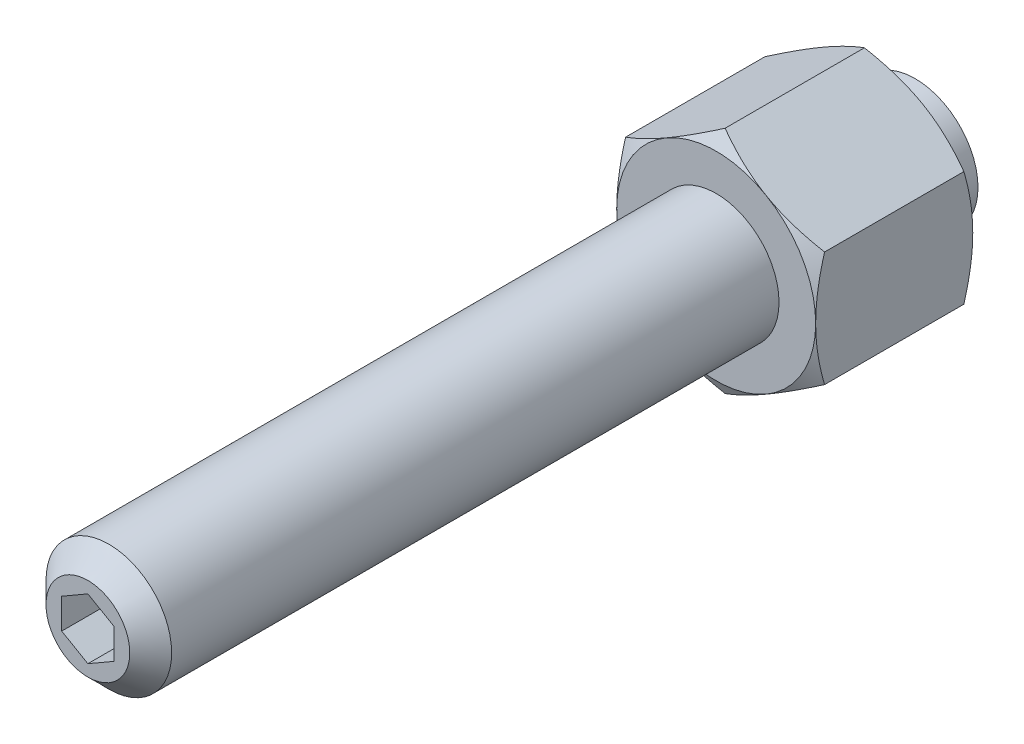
ISO-10303-21;
HEADER;
FILE_DESCRIPTION(('STEP AP214'),'2;1');
FILE_NAME('part.step','',(''),(''),'','','');
FILE_SCHEMA(('AUTOMOTIVE_DESIGN { 1 0 10303 214 1 1 1 1 }'));
ENDSEC;
DATA;
#1=APPLICATION_CONTEXT('core data for automotive mechanical design processes');
#2=APPLICATION_PROTOCOL_DEFINITION('international standard','automotive_design',2000,#1);
#3=PRODUCT_CONTEXT('',#1,'mechanical');
#4=PRODUCT('Part','Part','',(#3));
#5=PRODUCT_RELATED_PRODUCT_CATEGORY('part','',(#4));
#6=PRODUCT_DEFINITION_FORMATION('','',#4);
#7=PRODUCT_DEFINITION_CONTEXT('part definition',#1,'design');
#8=PRODUCT_DEFINITION('design','',#6,#7);
#9=PRODUCT_DEFINITION_SHAPE('','',#8);
#10=(LENGTH_UNIT() NAMED_UNIT(*) SI_UNIT(.MILLI.,.METRE.));
#11=(NAMED_UNIT(*) PLANE_ANGLE_UNIT() SI_UNIT($,.RADIAN.));
#12=(NAMED_UNIT(*) SI_UNIT($,.STERADIAN.) SOLID_ANGLE_UNIT());
#13=UNCERTAINTY_MEASURE_WITH_UNIT(LENGTH_MEASURE(1.E-05),#10,'distance_accuracy_value','');
#14=(GEOMETRIC_REPRESENTATION_CONTEXT(3) GLOBAL_UNCERTAINTY_ASSIGNED_CONTEXT((#13)) GLOBAL_UNIT_ASSIGNED_CONTEXT((#10,
#11,#12)) REPRESENTATION_CONTEXT('',''));
#15=CARTESIAN_POINT('',(0.,0.,0.));
#16=DIRECTION('',(0.,0.,1.));
#17=DIRECTION('',(1.,0.,0.));
#18=AXIS2_PLACEMENT_3D('',#15,#16,#17);
#19=CARTESIAN_POINT('',(0.,-10.9696551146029,59.));
#20=DIRECTION('',(-0.5,-0.866025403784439,0.));
#21=DIRECTION('',(-0.866025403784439,0.5,0.));
#22=AXIS2_PLACEMENT_3D('',#19,#20,#21);
#23=PLANE('',#22);
#24=DIRECTION('',(0.,0.,-1.));
#25=VECTOR('',#24,1.);
#26=CARTESIAN_POINT('',(-9.5,-5.48482755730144,59.));
#27=LINE('',#26,#25);
#28=CARTESIAN_POINT('',(-9.5,-5.48482755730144,18.1514942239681));
#29=VERTEX_POINT('',#28);
#30=CARTESIAN_POINT('',(-9.5,-5.48482755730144,4.84850577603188));
#31=VERTEX_POINT('',#30);
#32=EDGE_CURVE('E170',#29,#31,#27,.T.);
#33=ORIENTED_EDGE('',*,*,#32,.T.);
#34=CARTESIAN_POINT('',(-9.5002,-5.48471208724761,4.84857244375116));
#35=CARTESIAN_POINT('',(-9.2913692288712,-5.6052805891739,4.77897343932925));
#36=CARTESIAN_POINT('',(-9.08175982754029,-5.72629863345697,4.71253330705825));
#37=CARTESIAN_POINT('',(-8.66086011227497,-5.96930519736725,4.58684728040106));
#38=CARTESIAN_POINT('',(-8.44956926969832,-6.09129402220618,4.52760375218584));
#39=CARTESIAN_POINT('',(-7.81229220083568,-6.45922610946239,4.3618145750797));
#40=CARTESIAN_POINT('',(-7.38379023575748,-6.70662183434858,4.26751444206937));
#41=CARTESIAN_POINT('',(-6.74255666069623,-7.07683821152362,4.15693870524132));
#42=CARTESIAN_POINT('',(-6.53174078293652,-7.19855281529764,4.12543982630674));
#43=CARTESIAN_POINT('',(-6.10913296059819,-7.44254555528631,4.07261820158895));
#44=CARTESIAN_POINT('',(-5.89734099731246,-7.56482370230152,4.05129565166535));
#45=CARTESIAN_POINT('',(-5.47340378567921,-7.80958396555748,4.01937302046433));
#46=CARTESIAN_POINT('',(-5.26125925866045,-7.93206566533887,4.0087601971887));
#47=CARTESIAN_POINT('',(-4.83677424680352,-8.17714220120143,3.9984825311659));
#48=CARTESIAN_POINT('',(-4.62443376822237,-8.29973703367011,3.99881735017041));
#49=CARTESIAN_POINT('',(-4.22745800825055,-8.5289310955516,4.00967336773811));
#50=CARTESIAN_POINT('',(-4.04279470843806,-8.63554650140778,4.01887026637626));
#51=CARTESIAN_POINT('',(-3.67389999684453,-8.84852796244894,4.04536539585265));
#52=CARTESIAN_POINT('',(-3.48966861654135,-8.95489399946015,4.06266419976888));
#53=CARTESIAN_POINT('',(-2.93768832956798,-9.27357996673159,4.12630448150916));
#54=CARTESIAN_POINT('',(-2.57091646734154,-9.48533580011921,4.18438190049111));
#55=CARTESIAN_POINT('',(-1.83348217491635,-9.91109368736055,4.32957601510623));
#56=CARTESIAN_POINT('',(-1.46291385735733,-10.1250414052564,4.41730816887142));
#57=CARTESIAN_POINT('',(-0.727303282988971,-10.5497463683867,4.61642373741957));
#58=CARTESIAN_POINT('',(-0.362251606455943,-10.7605090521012,4.72776038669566));
#59=CARTESIAN_POINT('',(0.000200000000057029,-10.9697705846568,4.84857244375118));
#60=B_SPLINE_CURVE_WITH_KNOTS('',3,(#34,#35,#36,#37,#38,#39,#40,#41,#42,#43,#44,#45,#46,#47,#48,
#49,#50,#51,#52,#53,#54,#55,#56,#57,#58,#59),.UNSPECIFIED.,.F.,.F.,(4,2,2,2,2,2,2,2,2,2,2,2,4),
(0.,0.752880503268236,1.50600787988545,3.0154687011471,3.75167336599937,4.48789219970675,
5.22323407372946,5.95855322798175,6.59868084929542,7.23885375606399,8.52010929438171,
9.829780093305,11.1368800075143),.UNSPECIFIED.);
#61=CARTESIAN_POINT('',(-4.75,-8.22724133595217,4.));
#62=VERTEX_POINT('',#61);
#63=EDGE_CURVE('E149',#31,#62,#60,.T.);
#64=ORIENTED_EDGE('',*,*,#63,.T.);
#65=CARTESIAN_POINT('',(0.,-10.9696551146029,4.84850577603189));
#66=VERTEX_POINT('',#65);
#67=EDGE_CURVE('E160',#62,#66,#60,.T.);
#68=ORIENTED_EDGE('',*,*,#67,.T.);
#69=DIRECTION('',(0.,0.,-1.));
#70=VECTOR('',#69,1.);
#71=CARTESIAN_POINT('',(0.,-10.9696551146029,59.));
#72=LINE('',#71,#70);
#73=CARTESIAN_POINT('',(0.,-10.9696551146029,18.1514942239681));
#74=VERTEX_POINT('',#73);
#75=EDGE_CURVE('E349',#74,#66,#72,.T.);
#76=ORIENTED_EDGE('',*,*,#75,.F.);
#77=CARTESIAN_POINT('',(0.000200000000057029,-10.9697705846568,18.1514275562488));
#78=CARTESIAN_POINT('',(-0.208630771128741,-10.8492020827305,18.2210265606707));
#79=CARTESIAN_POINT('',(-0.41824017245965,-10.7281840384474,18.2874666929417));
#80=CARTESIAN_POINT('',(-0.839139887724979,-10.4851774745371,18.4131527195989));
#81=CARTESIAN_POINT('',(-1.05043073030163,-10.3631886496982,18.4723962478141));
#82=CARTESIAN_POINT('',(-1.68770779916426,-9.99525656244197,18.6381854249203));
#83=CARTESIAN_POINT('',(-2.11620976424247,-9.74786083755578,18.7324855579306));
#84=CARTESIAN_POINT('',(-2.75744333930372,-9.37764446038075,18.8430612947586));
#85=CARTESIAN_POINT('',(-2.96825921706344,-9.25592985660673,18.8745601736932));
#86=CARTESIAN_POINT('',(-3.39086703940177,-9.01193711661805,18.927381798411));
#87=CARTESIAN_POINT('',(-3.60265900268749,-8.88965896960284,18.9487043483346));
#88=CARTESIAN_POINT('',(-4.02659621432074,-8.64489870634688,18.9806269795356));
#89=CARTESIAN_POINT('',(-4.23874074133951,-8.52241700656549,18.9912398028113));
#90=CARTESIAN_POINT('',(-4.66322575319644,-8.27734047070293,19.0015174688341));
#91=CARTESIAN_POINT('',(-4.8755662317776,-8.15474563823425,19.0011826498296));
#92=CARTESIAN_POINT('',(-5.27254199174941,-7.92555157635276,18.9903266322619));
#93=CARTESIAN_POINT('',(-5.4572052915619,-7.81893617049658,18.9811297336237));
#94=CARTESIAN_POINT('',(-5.82610000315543,-7.60595470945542,18.9546346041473));
#95=CARTESIAN_POINT('',(-6.01033138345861,-7.49958867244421,18.9373358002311));
#96=CARTESIAN_POINT('',(-6.56231167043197,-7.18090270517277,18.8736955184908));
#97=CARTESIAN_POINT('',(-6.92908353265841,-6.96914687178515,18.8156180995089));
#98=CARTESIAN_POINT('',(-7.66651782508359,-6.54338898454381,18.6704239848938));
#99=CARTESIAN_POINT('',(-8.03708614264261,-6.32944126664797,18.5826918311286));
#100=CARTESIAN_POINT('',(-8.77269671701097,-5.90473630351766,18.3835762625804));
#101=CARTESIAN_POINT('',(-9.137748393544,-5.69397361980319,18.2722396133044));
#102=CARTESIAN_POINT('',(-9.5002,-5.48471208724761,18.1514275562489));
#103=B_SPLINE_CURVE_WITH_KNOTS('',3,(#77,#78,#79,#80,#81,#82,#83,#84,#85,#86,#87,#88,#89,#90,
#91,#92,#93,#94,#95,#96,#97,#98,#99,#100,#101,#102),.UNSPECIFIED.,.F.,.F.,(4,2,2,2,2,2,2,2,2,2,
2,2,4),(0.,0.752880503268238,1.50600787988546,3.01546870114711,3.75167336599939,
4.48789219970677,5.22323407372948,5.95855322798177,6.59868084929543,7.238853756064,
8.52010929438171,9.82978009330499,11.1368800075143),.UNSPECIFIED.);
#104=CARTESIAN_POINT('',(-4.75,-8.22724133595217,19.));
#105=VERTEX_POINT('',#104);
#106=EDGE_CURVE('E347',#74,#105,#103,.T.);
#107=ORIENTED_EDGE('',*,*,#106,.T.);
#108=EDGE_CURVE('E235',#105,#29,#103,.T.);
#109=ORIENTED_EDGE('',*,*,#108,.T.);
#110=EDGE_LOOP('',(#33,#64,#68,#76,#107,#109));
#111=FACE_BOUND('',#110,.T.);
#112=ADVANCED_FACE('F14',(#111),#23,.T.);
#113=CARTESIAN_POINT('',(-9.5,-5.48482755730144,59.));
#114=DIRECTION('',(-1.,0.,0.));
#115=DIRECTION('',(0.,0.,-1.));
#116=AXIS2_PLACEMENT_3D('',#113,#114,#115);
#117=PLANE('',#116);
#118=DIRECTION('',(0.,0.,-1.));
#119=VECTOR('',#118,1.);
#120=CARTESIAN_POINT('',(-9.5,5.48482755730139,59.));
#121=LINE('',#120,#119);
#122=CARTESIAN_POINT('',(-9.5,5.48482755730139,18.1514942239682));
#123=VERTEX_POINT('',#122);
#124=CARTESIAN_POINT('',(-9.5,5.48482755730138,4.84850577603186));
#125=VERTEX_POINT('',#124);
#126=EDGE_CURVE('E306',#123,#125,#121,.T.);
#127=ORIENTED_EDGE('',*,*,#126,.T.);
#128=CARTESIAN_POINT('',(-9.5,-14.7361941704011,8.63784367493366));
#129=CARTESIAN_POINT('',(-9.5,-14.5287284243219,8.53717212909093));
#130=CARTESIAN_POINT('',(-9.5,-14.3210193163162,8.43700233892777));
#131=CARTESIAN_POINT('',(-9.5,-13.9050636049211,8.23777990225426));
#132=CARTESIAN_POINT('',(-9.5,-13.6968169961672,8.13872726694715));
#133=CARTESIAN_POINT('',(-9.5,-13.0711393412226,7.84338945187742));
#134=CARTESIAN_POINT('',(-9.5,-12.6528317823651,7.64895419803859));
#135=CARTESIAN_POINT('',(-9.5,-11.8111435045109,7.26514574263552));
#136=CARTESIAN_POINT('',(-9.5,-11.3877475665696,7.0758058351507));
#137=CARTESIAN_POINT('',(-9.5,-10.5375901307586,6.70486673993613));
#138=CARTESIAN_POINT('',(-9.5,-10.1108287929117,6.52326718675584));
#139=CARTESIAN_POINT('',(-9.5,-9.23945455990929,6.1641673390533));
#140=CARTESIAN_POINT('',(-9.5,-8.7947090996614,5.98698695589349));
#141=CARTESIAN_POINT('',(-9.5,-7.90001723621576,5.64602763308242));
#142=CARTESIAN_POINT('',(-9.5,-7.45007025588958,5.48225019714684));
#143=CARTESIAN_POINT('',(-9.5,-6.54509518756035,5.17239473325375));
#144=CARTESIAN_POINT('',(-9.5,-6.09007949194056,5.02628090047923));
#145=CARTESIAN_POINT('',(-9.5,-5.17353730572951,4.75643714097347));
#146=CARTESIAN_POINT('',(-9.5,-4.7120129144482,4.63270016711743));
#147=CARTESIAN_POINT('',(-9.5,-3.78468709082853,4.41421522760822));
#148=CARTESIAN_POINT('',(-9.5,-3.31892389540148,4.31930935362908));
#149=CARTESIAN_POINT('',(-9.5,-2.61603494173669,4.20267855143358));
#150=CARTESIAN_POINT('',(-9.5,-2.38101398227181,4.16808803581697));
#151=CARTESIAN_POINT('',(-9.5,-1.90980276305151,4.10816141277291));
#152=CARTESIAN_POINT('',(-9.5,-1.67361261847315,4.08282441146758));
#153=CARTESIAN_POINT('',(-9.5,-1.20346604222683,4.04222750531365));
#154=CARTESIAN_POINT('',(-9.5,-0.969520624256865,4.02684055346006));
#155=CARTESIAN_POINT('',(-9.5,-0.501188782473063,4.00597354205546));
#156=CARTESIAN_POINT('',(-9.5,-0.266802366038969,4.000493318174));
#157=CARTESIAN_POINT('',(-9.5,0.20199226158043,3.99957049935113));
#158=CARTESIAN_POINT('',(-9.5,0.436400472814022,4.00412792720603));
#159=CARTESIAN_POINT('',(-9.5,0.90481636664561,4.02316899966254));
#160=CARTESIAN_POINT('',(-9.5,1.13882402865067,4.03765314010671));
#161=CARTESIAN_POINT('',(-9.5,1.7011288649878,4.08407795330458));
#162=CARTESIAN_POINT('',(-9.5,2.02904577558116,4.12072373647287));
#163=CARTESIAN_POINT('',(-9.5,2.68243242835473,4.21150929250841));
#164=CARTESIAN_POINT('',(-9.5,3.00790183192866,4.26565144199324));
#165=CARTESIAN_POINT('',(-9.5,3.98027532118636,4.45145041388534));
#166=CARTESIAN_POINT('',(-9.5,4.62277823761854,4.60644551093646));
#167=CARTESIAN_POINT('',(-9.5,5.58346417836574,4.87505145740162));
#168=CARTESIAN_POINT('',(-9.5,5.90663496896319,4.97184795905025));
#169=CARTESIAN_POINT('',(-9.5,6.54983759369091,5.17545425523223));
#170=CARTESIAN_POINT('',(-9.5,6.86986940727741,5.28226411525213));
#171=CARTESIAN_POINT('',(-9.5,7.50689517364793,5.50418680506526));
#172=CARTESIAN_POINT('',(-9.5,7.82389009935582,5.61929686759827));
#173=CARTESIAN_POINT('',(-9.5,8.45525663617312,5.85646965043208));
#174=CARTESIAN_POINT('',(-9.5,8.76962827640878,5.9785322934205));
#175=CARTESIAN_POINT('',(-9.5,9.50481271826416,6.27185363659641));
#176=CARTESIAN_POINT('',(-9.5,9.92468015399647,6.44547725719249));
#177=CARTESIAN_POINT('',(-9.5,10.7608894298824,6.80104051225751));
#178=CARTESIAN_POINT('',(-9.5,11.1772310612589,6.98298063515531));
#179=CARTESIAN_POINT('',(-9.5,12.0070357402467,7.35353104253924));
#180=CARTESIAN_POINT('',(-9.5,12.4204981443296,7.54214276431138));
#181=CARTESIAN_POINT('',(-9.5,13.244928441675,7.9247068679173));
#182=CARTESIAN_POINT('',(-9.5,13.6558963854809,8.11865914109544));
#183=CARTESIAN_POINT('',(-9.5,14.4761854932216,8.51112477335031));
#184=CARTESIAN_POINT('',(-9.5,14.8855044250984,8.70964278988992));
#185=CARTESIAN_POINT('',(-9.5,15.7023793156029,9.11027185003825));
#186=CARTESIAN_POINT('',(-9.5,16.1099352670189,9.31238290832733));
#187=CARTESIAN_POINT('',(-9.5,17.3302742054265,9.92310922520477));
#188=CARTESIAN_POINT('',(-9.5,18.1408330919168,10.3361681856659));
#189=CARTESIAN_POINT('',(-9.5,19.6908296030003,11.1361738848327));
#190=CARTESIAN_POINT('',(-9.5,20.4306104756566,11.5224585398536));
#191=CARTESIAN_POINT('',(-9.5,21.9074022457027,12.3003437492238));
#192=CARTESIAN_POINT('',(-9.5,22.6444130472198,12.6919444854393));
#193=CARTESIAN_POINT('',(-9.5,24.1144583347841,13.4782474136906));
#194=CARTESIAN_POINT('',(-9.5,24.8474981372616,13.8729396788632));
#195=CARTESIAN_POINT('',(-9.5,25.945748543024,14.4673478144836));
#196=CARTESIAN_POINT('',(-9.5,26.3116041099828,14.665873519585));
#197=CARTESIAN_POINT('',(-9.5,27.0429278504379,15.0636358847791));
#198=CARTESIAN_POINT('',(-9.5,27.4083960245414,15.2628725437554));
#199=CARTESIAN_POINT('',(-9.5,27.7736923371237,15.4624238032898));
#200=B_SPLINE_CURVE_WITH_KNOTS('',3,(#128,#129,#130,#131,#132,#133,#134,#135,#136,#137,#138,
#139,#140,#141,#142,#143,#144,#145,#146,#147,#148,#149,#150,#151,#152,#153,#154,#155,#156,#157,
#158,#159,#160,#161,#162,#163,#164,#165,#166,#167,#168,#169,#170,#171,#172,#173,#174,#175,#176,
#177,#178,#179,#180,#181,#182,#183,#184,#185,#186,#187,#188,#189,#190,#191,#192,#193,#194,#195,
#196,#197,#198,#199),.UNSPECIFIED.,.F.,.F.,(4,2,2,2,2,2,2,2,2,2,2,2,2,2,2,2,2,2,2,2,2,2,2,2,2,2,
2,2,2,2,2,2,2,2,2,4),(0.,0.691801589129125,1.38361010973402,2.76743170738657,4.15878177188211,
5.55006607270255,6.98611673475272,8.4223282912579,9.85557795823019,11.2883754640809,
12.7131778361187,13.4256828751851,14.1381190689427,14.8412688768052,15.5444070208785,
16.2475467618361,16.9507216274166,17.9400371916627,18.9294871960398,20.9094863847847,
21.9214697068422,22.9334596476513,23.9451137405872,24.9567565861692,26.3196862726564,
27.6826961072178,29.0460013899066,30.4092789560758,31.7740149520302,33.1387565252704,
35.867890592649,38.3715495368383,40.8752943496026,43.3729161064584,44.6216607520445,
45.8704034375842),.UNSPECIFIED.);
#201=CARTESIAN_POINT('',(-9.5,0.,4.));
#202=VERTEX_POINT('',#201);
#203=EDGE_CURVE('E289',#125,#202,#200,.F.);
#204=ORIENTED_EDGE('',*,*,#203,.T.);
#205=EDGE_CURVE('E151',#202,#31,#200,.F.);
#206=ORIENTED_EDGE('',*,*,#205,.T.);
#207=ORIENTED_EDGE('',*,*,#32,.F.);
#208=CARTESIAN_POINT('',(-9.5,-14.7361941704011,14.3621563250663));
#209=CARTESIAN_POINT('',(-9.5,-14.5287284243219,14.4628278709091));
#210=CARTESIAN_POINT('',(-9.5,-14.3210193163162,14.5629976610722));
#211=CARTESIAN_POINT('',(-9.5,-13.9050636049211,14.7622200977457));
#212=CARTESIAN_POINT('',(-9.5,-13.6968169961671,14.8612727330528));
#213=CARTESIAN_POINT('',(-9.5,-13.0711393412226,15.1566105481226));
#214=CARTESIAN_POINT('',(-9.5,-12.6528317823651,15.3510458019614));
#215=CARTESIAN_POINT('',(-9.5,-11.8111435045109,15.7348542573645));
#216=CARTESIAN_POINT('',(-9.5,-11.3877475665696,15.9241941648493));
#217=CARTESIAN_POINT('',(-9.5,-10.5375901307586,16.2951332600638));
#218=CARTESIAN_POINT('',(-9.5,-10.1108287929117,16.4767328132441));
#219=CARTESIAN_POINT('',(-9.5,-9.23945455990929,16.8358326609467));
#220=CARTESIAN_POINT('',(-9.5,-8.7947090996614,17.0130130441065));
#221=CARTESIAN_POINT('',(-9.5,-7.90001723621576,17.3539723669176));
#222=CARTESIAN_POINT('',(-9.5,-7.45007025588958,17.5177498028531));
#223=CARTESIAN_POINT('',(-9.5,-6.54509518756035,17.8276052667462));
#224=CARTESIAN_POINT('',(-9.5,-6.09007949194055,17.9737190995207));
#225=CARTESIAN_POINT('',(-9.5,-5.17353730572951,18.2435628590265));
#226=CARTESIAN_POINT('',(-9.5,-4.71201291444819,18.3672998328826));
#227=CARTESIAN_POINT('',(-9.5,-3.78468709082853,18.5857847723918));
#228=CARTESIAN_POINT('',(-9.5,-3.31892389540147,18.6806906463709));
#229=CARTESIAN_POINT('',(-9.5,-2.61603494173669,18.7973214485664));
#230=CARTESIAN_POINT('',(-9.5,-2.38101398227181,18.831911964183));
#231=CARTESIAN_POINT('',(-9.5,-1.90980276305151,18.8918385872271));
#232=CARTESIAN_POINT('',(-9.5,-1.67361261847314,18.9171755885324));
#233=CARTESIAN_POINT('',(-9.5,-1.20346604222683,18.9577724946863));
#234=CARTESIAN_POINT('',(-9.5,-0.969520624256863,18.9731594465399));
#235=CARTESIAN_POINT('',(-9.5,-0.50118878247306,18.9940264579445));
#236=CARTESIAN_POINT('',(-9.5,-0.266802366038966,18.999506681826));
#237=CARTESIAN_POINT('',(-9.5,0.201992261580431,19.0004295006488));
#238=CARTESIAN_POINT('',(-9.5,0.436400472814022,18.9958720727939));
#239=CARTESIAN_POINT('',(-9.5,0.90481636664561,18.9768310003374));
#240=CARTESIAN_POINT('',(-9.5,1.13882402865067,18.9623468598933));
#241=CARTESIAN_POINT('',(-9.5,1.7011288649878,18.9159220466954));
#242=CARTESIAN_POINT('',(-9.5,2.02904577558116,18.8792762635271));
#243=CARTESIAN_POINT('',(-9.5,2.68243242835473,18.7884907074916));
#244=CARTESIAN_POINT('',(-9.5,3.00790183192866,18.7343485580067));
#245=CARTESIAN_POINT('',(-9.5,3.98027532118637,18.5485495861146));
#246=CARTESIAN_POINT('',(-9.5,4.62277823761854,18.3935544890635));
#247=CARTESIAN_POINT('',(-9.5,5.58346417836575,18.1249485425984));
#248=CARTESIAN_POINT('',(-9.5,5.90663496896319,18.0281520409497));
#249=CARTESIAN_POINT('',(-9.5,6.54983759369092,17.8245457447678));
#250=CARTESIAN_POINT('',(-9.5,6.86986940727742,17.7177358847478));
#251=CARTESIAN_POINT('',(-9.5,7.50689517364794,17.4958131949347));
#252=CARTESIAN_POINT('',(-9.5,7.82389009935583,17.3807031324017));
#253=CARTESIAN_POINT('',(-9.5,8.45525663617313,17.1435303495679));
#254=CARTESIAN_POINT('',(-9.5,8.7696282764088,17.0214677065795));
#255=CARTESIAN_POINT('',(-9.5,9.50481271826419,16.7281463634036));
#256=CARTESIAN_POINT('',(-9.5,9.92468015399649,16.5545227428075));
#257=CARTESIAN_POINT('',(-9.5,10.7608894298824,16.1989594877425));
#258=CARTESIAN_POINT('',(-9.5,11.1772310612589,16.0170193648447));
#259=CARTESIAN_POINT('',(-9.5,12.0070357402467,15.6464689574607));
#260=CARTESIAN_POINT('',(-9.5,12.4204981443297,15.4578572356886));
#261=CARTESIAN_POINT('',(-9.5,13.244928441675,15.0752931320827));
#262=CARTESIAN_POINT('',(-9.5,13.6558963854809,14.8813408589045));
#263=CARTESIAN_POINT('',(-9.5,14.4761854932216,14.4888752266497));
#264=CARTESIAN_POINT('',(-9.5,14.8855044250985,14.2903572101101));
#265=CARTESIAN_POINT('',(-9.5,15.7023793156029,13.8897281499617));
#266=CARTESIAN_POINT('',(-9.5,16.109935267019,13.6876170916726));
#267=CARTESIAN_POINT('',(-9.5,17.3302742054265,13.0768907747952));
#268=CARTESIAN_POINT('',(-9.5,18.1408330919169,12.6638318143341));
#269=CARTESIAN_POINT('',(-9.5,19.6908296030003,11.8638261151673));
#270=CARTESIAN_POINT('',(-9.5,20.4306104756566,11.4775414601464));
#271=CARTESIAN_POINT('',(-9.5,21.9074022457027,10.6996562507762));
#272=CARTESIAN_POINT('',(-9.5,22.6444130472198,10.3080555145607));
#273=CARTESIAN_POINT('',(-9.5,24.1144583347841,9.52175258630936));
#274=CARTESIAN_POINT('',(-9.5,24.8474981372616,9.12706032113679));
#275=CARTESIAN_POINT('',(-9.5,25.945748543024,8.53265218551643));
#276=CARTESIAN_POINT('',(-9.5,26.3116041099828,8.33412648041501));
#277=CARTESIAN_POINT('',(-9.5,27.0429278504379,7.93636411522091));
#278=CARTESIAN_POINT('',(-9.5,27.4083960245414,7.73712745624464));
#279=CARTESIAN_POINT('',(-9.5,27.7736923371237,7.53757619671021));
#280=B_SPLINE_CURVE_WITH_KNOTS('',3,(#208,#209,#210,#211,#212,#213,#214,#215,#216,#217,#218,
#219,#220,#221,#222,#223,#224,#225,#226,#227,#228,#229,#230,#231,#232,#233,#234,#235,#236,#237,
#238,#239,#240,#241,#242,#243,#244,#245,#246,#247,#248,#249,#250,#251,#252,#253,#254,#255,#256,
#257,#258,#259,#260,#261,#262,#263,#264,#265,#266,#267,#268,#269,#270,#271,#272,#273,#274,#275,
#276,#277,#278,#279),.UNSPECIFIED.,.F.,.F.,(4,2,2,2,2,2,2,2,2,2,2,2,2,2,2,2,2,2,2,2,2,2,2,2,2,2,
2,2,2,2,2,2,2,2,2,4),(0.,0.691801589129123,1.38361010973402,2.76743170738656,4.1587817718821,
5.55006607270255,6.98611673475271,8.42232829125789,9.85557795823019,11.2883754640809,
12.7131778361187,13.4256828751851,14.1381190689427,14.8412688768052,15.5444070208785,
16.247546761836,16.9507216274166,17.9400371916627,18.9294871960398,20.9094863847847,
21.9214697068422,22.9334596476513,23.9451137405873,24.9567565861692,26.3196862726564,
27.6826961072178,29.0460013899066,30.4092789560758,31.7740149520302,33.1387565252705,
35.867890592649,38.3715495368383,40.8752943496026,43.3729161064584,44.6216607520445,
45.8704034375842),.UNSPECIFIED.);
#281=CARTESIAN_POINT('',(-9.5,0.,19.));
#282=VERTEX_POINT('',#281);
#283=EDGE_CURVE('E245',#29,#282,#280,.T.);
#284=ORIENTED_EDGE('',*,*,#283,.T.);
#285=EDGE_CURVE('E265',#282,#123,#280,.T.);
#286=ORIENTED_EDGE('',*,*,#285,.T.);
#287=EDGE_LOOP('',(#127,#204,#206,#207,#284,#286));
#288=FACE_BOUND('',#287,.T.);
#289=ADVANCED_FACE('F269',(#288),#117,.T.);
#290=CARTESIAN_POINT('',(0.,10.9696551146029,59.));
#291=DIRECTION('',(0.500000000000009,-0.866025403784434,0.));
#292=DIRECTION('',(-0.866025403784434,-0.500000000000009,0.));
#293=AXIS2_PLACEMENT_3D('',#290,#291,#292);
#294=PLANE('',#293);
#295=CARTESIAN_POINT('',(-9.5002,5.48471208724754,4.84857244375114));
#296=CARTESIAN_POINT('',(-9.2913692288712,5.60528058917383,4.77897343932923));
#297=CARTESIAN_POINT('',(-9.0817598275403,5.72629863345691,4.71253330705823));
#298=CARTESIAN_POINT('',(-8.66086011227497,5.96930519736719,4.58684728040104));
#299=CARTESIAN_POINT('',(-8.44956926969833,6.09129402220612,4.52760375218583));
#300=CARTESIAN_POINT('',(-7.8122922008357,6.45922610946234,4.36181457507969));
#301=CARTESIAN_POINT('',(-7.3837902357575,6.70662183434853,4.26751444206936));
#302=CARTESIAN_POINT('',(-6.74255666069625,7.07683821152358,4.15693870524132));
#303=CARTESIAN_POINT('',(-6.53174078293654,7.1985528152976,4.12543982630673));
#304=CARTESIAN_POINT('',(-6.10913296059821,7.44254555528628,4.07261820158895));
#305=CARTESIAN_POINT('',(-5.89734099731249,7.56482370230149,4.05129565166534));
#306=CARTESIAN_POINT('',(-5.47340378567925,7.80958396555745,4.01937302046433));
#307=CARTESIAN_POINT('',(-5.26125925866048,7.93206566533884,4.0087601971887));
#308=CARTESIAN_POINT('',(-4.83677424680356,8.1771422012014,3.9984825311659));
#309=CARTESIAN_POINT('',(-4.6244337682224,8.29973703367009,3.99881735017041));
#310=CARTESIAN_POINT('',(-4.22745800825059,8.52893109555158,4.00967336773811));
#311=CARTESIAN_POINT('',(-4.04279470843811,8.63554650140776,4.01887026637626));
#312=CARTESIAN_POINT('',(-3.67389999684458,8.84852796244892,4.04536539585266));
#313=CARTESIAN_POINT('',(-3.4896686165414,8.95489399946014,4.06266419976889));
#314=CARTESIAN_POINT('',(-2.93768832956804,9.27357996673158,4.12630448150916));
#315=CARTESIAN_POINT('',(-2.57091646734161,9.4853358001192,4.18438190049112));
#316=CARTESIAN_POINT('',(-1.83348217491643,9.91109368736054,4.32957601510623));
#317=CARTESIAN_POINT('',(-1.46291385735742,10.1250414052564,4.41730816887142));
#318=CARTESIAN_POINT('',(-0.727303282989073,10.5497463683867,4.61642373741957));
#319=CARTESIAN_POINT('',(-0.36225160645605,10.7605090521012,4.72776038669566));
#320=CARTESIAN_POINT('',(0.000199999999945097,10.9697705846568,4.84857244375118));
#321=B_SPLINE_CURVE_WITH_KNOTS('',3,(#295,#296,#297,#298,#299,#300,#301,#302,#303,#304,#305,
#306,#307,#308,#309,#310,#311,#312,#313,#314,#315,#316,#317,#318,#319,#320),.UNSPECIFIED.,.F.,
.F.,(4,2,2,2,2,2,2,2,2,2,2,2,4),(0.,0.752880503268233,1.50600787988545,3.01546870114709,
3.75167336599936,4.48789219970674,5.22323407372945,5.95855322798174,6.5986808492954,
7.23885375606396,8.52010929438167,9.82978009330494,11.1368800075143),.UNSPECIFIED.);
#322=CARTESIAN_POINT('',(-4.75000000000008,8.22724133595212,4.));
#323=VERTEX_POINT('',#322);
#324=EDGE_CURVE('E280',#125,#323,#321,.T.);
#325=ORIENTED_EDGE('',*,*,#324,.F.);
#326=ORIENTED_EDGE('',*,*,#126,.F.);
#327=CARTESIAN_POINT('',(0.000199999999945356,10.9697705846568,18.1514275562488));
#328=CARTESIAN_POINT('',(-0.208630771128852,10.8492020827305,18.2210265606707));
#329=CARTESIAN_POINT('',(-0.418240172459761,10.7281840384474,18.2874666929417));
#330=CARTESIAN_POINT('',(-0.839139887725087,10.4851774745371,18.4131527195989));
#331=CARTESIAN_POINT('',(-1.05043073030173,10.3631886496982,18.4723962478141));
#332=CARTESIAN_POINT('',(-1.68770779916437,9.99525656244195,18.6381854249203));
#333=CARTESIAN_POINT('',(-2.11620976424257,9.74786083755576,18.7324855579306));
#334=CARTESIAN_POINT('',(-2.75744333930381,9.37764446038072,18.8430612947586));
#335=CARTESIAN_POINT('',(-2.96825921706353,9.2559298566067,18.8745601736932));
#336=CARTESIAN_POINT('',(-3.39086703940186,9.01193711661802,18.927381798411));
#337=CARTESIAN_POINT('',(-3.60265900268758,8.8896589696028,18.9487043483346));
#338=CARTESIAN_POINT('',(-4.02659621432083,8.64489870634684,18.9806269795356));
#339=CARTESIAN_POINT('',(-4.23874074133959,8.52241700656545,18.9912398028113));
#340=CARTESIAN_POINT('',(-4.66322575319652,8.27734047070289,19.0015174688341));
#341=CARTESIAN_POINT('',(-4.87556623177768,8.1547456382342,19.0011826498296));
#342=CARTESIAN_POINT('',(-5.27254199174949,7.92555157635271,18.9903266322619));
#343=CARTESIAN_POINT('',(-5.45720529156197,7.81893617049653,18.9811297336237));
#344=CARTESIAN_POINT('',(-5.82610000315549,7.60595470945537,18.9546346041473));
#345=CARTESIAN_POINT('',(-6.01033138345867,7.49958867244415,18.9373358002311));
#346=CARTESIAN_POINT('',(-6.56231167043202,7.18090270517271,18.8736955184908));
#347=CARTESIAN_POINT('',(-6.92908353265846,6.9691468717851,18.8156180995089));
#348=CARTESIAN_POINT('',(-7.66651782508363,6.54338898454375,18.6704239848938));
#349=CARTESIAN_POINT('',(-8.03708614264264,6.3294412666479,18.5826918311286));
#350=CARTESIAN_POINT('',(-8.77269671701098,5.9047363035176,18.3835762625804));
#351=CARTESIAN_POINT('',(-9.137748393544,5.69397361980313,18.2722396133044));
#352=CARTESIAN_POINT('',(-9.5002,5.48471208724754,18.1514275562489));
#353=B_SPLINE_CURVE_WITH_KNOTS('',3,(#327,#328,#329,#330,#331,#332,#333,#334,#335,#336,#337,
#338,#339,#340,#341,#342,#343,#344,#345,#346,#347,#348,#349,#350,#351,#352),.UNSPECIFIED.,.F.,
.F.,(4,2,2,2,2,2,2,2,2,2,2,2,4),(0.,0.75288050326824,1.50600787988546,3.01546870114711,
3.75167336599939,4.48789219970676,5.22323407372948,5.95855322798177,6.59868084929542,
7.23885375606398,8.52010929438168,9.82978009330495,11.1368800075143),.UNSPECIFIED.);
#354=CARTESIAN_POINT('',(-4.75000000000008,8.22724133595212,19.));
#355=VERTEX_POINT('',#354);
#356=EDGE_CURVE('E259',#355,#123,#353,.T.);
#357=ORIENTED_EDGE('',*,*,#356,.F.);
#358=CARTESIAN_POINT('',(0.,10.9696551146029,18.1514942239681));
#359=VERTEX_POINT('',#358);
#360=EDGE_CURVE('E264',#359,#355,#353,.T.);
#361=ORIENTED_EDGE('',*,*,#360,.F.);
#362=DIRECTION('',(0.,0.,-1.));
#363=VECTOR('',#362,1.);
#364=CARTESIAN_POINT('',(0.,10.9696551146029,59.));
#365=LINE('',#364,#363);
#366=CARTESIAN_POINT('',(0.,10.9696551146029,4.84850577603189));
#367=VERTEX_POINT('',#366);
#368=EDGE_CURVE('E314',#359,#367,#365,.T.);
#369=ORIENTED_EDGE('',*,*,#368,.T.);
#370=EDGE_CURVE('E274',#323,#367,#321,.T.);
#371=ORIENTED_EDGE('',*,*,#370,.F.);
#372=EDGE_LOOP('',(#325,#326,#357,#361,#369,#371));
#373=FACE_BOUND('',#372,.T.);
#374=ADVANCED_FACE('F266',(#373),#294,.F.);
#375=CARTESIAN_POINT('',(0.,10.9696551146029,59.));
#376=DIRECTION('',(0.5,0.866025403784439,0.));
#377=DIRECTION('',(0.866025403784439,-0.5,0.));
#378=AXIS2_PLACEMENT_3D('',#375,#376,#377);
#379=PLANE('',#378);
#380=DIRECTION('',(0.,0.,-1.));
#381=VECTOR('',#380,1.);
#382=CARTESIAN_POINT('',(9.5,5.48482755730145,59.));
#383=LINE('',#382,#381);
#384=CARTESIAN_POINT('',(9.5,5.48482755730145,18.1514942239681));
#385=VERTEX_POINT('',#384);
#386=CARTESIAN_POINT('',(9.5,5.48482755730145,4.84850577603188));
#387=VERTEX_POINT('',#386);
#388=EDGE_CURVE('E326',#385,#387,#383,.T.);
#389=ORIENTED_EDGE('',*,*,#388,.T.);
#390=CARTESIAN_POINT('',(9.5002,5.48471208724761,4.84857244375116));
#391=CARTESIAN_POINT('',(9.2913692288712,5.6052805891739,4.77897343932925));
#392=CARTESIAN_POINT('',(9.08175982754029,5.72629863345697,4.71253330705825));
#393=CARTESIAN_POINT('',(8.66086011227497,5.96930519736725,4.58684728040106));
#394=CARTESIAN_POINT('',(8.44956926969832,6.09129402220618,4.52760375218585));
#395=CARTESIAN_POINT('',(7.81229220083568,6.45922610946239,4.3618145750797));
#396=CARTESIAN_POINT('',(7.38379023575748,6.70662183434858,4.26751444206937));
#397=CARTESIAN_POINT('',(6.74255666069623,7.07683821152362,4.15693870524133));
#398=CARTESIAN_POINT('',(6.53174078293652,7.19855281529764,4.12543982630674));
#399=CARTESIAN_POINT('',(6.10913296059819,7.44254555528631,4.07261820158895));
#400=CARTESIAN_POINT('',(5.89734099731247,7.56482370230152,4.05129565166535));
#401=CARTESIAN_POINT('',(5.47340378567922,7.80958396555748,4.01937302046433));
#402=CARTESIAN_POINT('',(5.26125925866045,7.93206566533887,4.0087601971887));
#403=CARTESIAN_POINT('',(4.83677424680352,8.17714220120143,3.9984825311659));
#404=CARTESIAN_POINT('',(4.62443376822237,8.29973703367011,3.99881735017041));
#405=CARTESIAN_POINT('',(4.22745800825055,8.5289310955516,4.00967336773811));
#406=CARTESIAN_POINT('',(4.04279470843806,8.63554650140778,4.01887026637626));
#407=CARTESIAN_POINT('',(3.67389999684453,8.84852796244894,4.04536539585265));
#408=CARTESIAN_POINT('',(3.48966861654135,8.95489399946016,4.06266419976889));
#409=CARTESIAN_POINT('',(2.93768832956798,9.2735799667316,4.12630448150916));
#410=CARTESIAN_POINT('',(2.57091646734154,9.48533580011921,4.18438190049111));
#411=CARTESIAN_POINT('',(1.83348217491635,9.91109368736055,4.32957601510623));
#412=CARTESIAN_POINT('',(1.46291385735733,10.1250414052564,4.41730816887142));
#413=CARTESIAN_POINT('',(0.727303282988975,10.5497463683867,4.61642373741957));
#414=CARTESIAN_POINT('',(0.362251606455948,10.7605090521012,4.72776038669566));
#415=CARTESIAN_POINT('',(-0.000200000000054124,10.9697705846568,4.84857244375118));
#416=B_SPLINE_CURVE_WITH_KNOTS('',3,(#390,#391,#392,#393,#394,#395,#396,#397,#398,#399,#400,
#401,#402,#403,#404,#405,#406,#407,#408,#409,#410,#411,#412,#413,#414,#415),.UNSPECIFIED.,.F.,
.F.,(4,2,2,2,2,2,2,2,2,2,2,2,4),(0.,0.752880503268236,1.50600787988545,3.0154687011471,
3.75167336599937,4.48789219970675,5.22323407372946,5.95855322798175,6.59868084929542,
7.23885375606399,8.52010929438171,9.82978009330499,11.1368800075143),.UNSPECIFIED.);
#417=CARTESIAN_POINT('',(4.75,8.22724133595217,4.));
#418=VERTEX_POINT('',#417);
#419=EDGE_CURVE('E165',#387,#418,#416,.T.);
#420=ORIENTED_EDGE('',*,*,#419,.T.);
#421=EDGE_CURVE('E171',#418,#367,#416,.T.);
#422=ORIENTED_EDGE('',*,*,#421,.T.);
#423=ORIENTED_EDGE('',*,*,#368,.F.);
#424=CARTESIAN_POINT('',(-0.000200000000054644,10.9697705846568,18.1514275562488));
#425=CARTESIAN_POINT('',(0.208630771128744,10.8492020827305,18.2210265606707));
#426=CARTESIAN_POINT('',(0.418240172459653,10.7281840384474,18.2874666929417));
#427=CARTESIAN_POINT('',(0.839139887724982,10.4851774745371,18.4131527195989));
#428=CARTESIAN_POINT('',(1.05043073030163,10.3631886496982,18.4723962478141));
#429=CARTESIAN_POINT('',(1.68770779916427,9.99525656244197,18.6381854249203));
#430=CARTESIAN_POINT('',(2.11620976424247,9.74786083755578,18.7324855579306));
#431=CARTESIAN_POINT('',(2.75744333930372,9.37764446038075,18.8430612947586));
#432=CARTESIAN_POINT('',(2.96825921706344,9.25592985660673,18.8745601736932));
#433=CARTESIAN_POINT('',(3.39086703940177,9.01193711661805,18.927381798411));
#434=CARTESIAN_POINT('',(3.60265900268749,8.88965896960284,18.9487043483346));
#435=CARTESIAN_POINT('',(4.02659621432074,8.64489870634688,18.9806269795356));
#436=CARTESIAN_POINT('',(4.23874074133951,8.52241700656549,18.9912398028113));
#437=CARTESIAN_POINT('',(4.66322575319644,8.27734047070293,19.0015174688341));
#438=CARTESIAN_POINT('',(4.8755662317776,8.15474563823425,19.0011826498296));
#439=CARTESIAN_POINT('',(5.27254199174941,7.92555157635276,18.9903266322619));
#440=CARTESIAN_POINT('',(5.45720529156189,7.81893617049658,18.9811297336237));
#441=CARTESIAN_POINT('',(5.82610000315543,7.60595470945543,18.9546346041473));
#442=CARTESIAN_POINT('',(6.01033138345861,7.49958867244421,18.9373358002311));
#443=CARTESIAN_POINT('',(6.56231167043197,7.18090270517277,18.8736955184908));
#444=CARTESIAN_POINT('',(6.92908353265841,6.96914687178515,18.8156180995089));
#445=CARTESIAN_POINT('',(7.66651782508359,6.54338898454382,18.6704239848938));
#446=CARTESIAN_POINT('',(8.03708614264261,6.32944126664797,18.5826918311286));
#447=CARTESIAN_POINT('',(8.77269671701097,5.90473630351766,18.3835762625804));
#448=CARTESIAN_POINT('',(9.137748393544,5.6939736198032,18.2722396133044));
#449=CARTESIAN_POINT('',(9.5002,5.48471208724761,18.1514275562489));
#450=B_SPLINE_CURVE_WITH_KNOTS('',3,(#424,#425,#426,#427,#428,#429,#430,#431,#432,#433,#434,
#435,#436,#437,#438,#439,#440,#441,#442,#443,#444,#445,#446,#447,#448,#449),.UNSPECIFIED.,.F.,
.F.,(4,2,2,2,2,2,2,2,2,2,2,2,4),(0.,0.752880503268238,1.50600787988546,3.01546870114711,
3.75167336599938,4.48789219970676,5.22323407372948,5.95855322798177,6.59868084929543,
7.238853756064,8.52010929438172,9.82978009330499,11.1368800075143),.UNSPECIFIED.);
#451=CARTESIAN_POINT('',(4.75,8.22724133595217,19.));
#452=VERTEX_POINT('',#451);
#453=EDGE_CURVE('E215',#359,#452,#450,.T.);
#454=ORIENTED_EDGE('',*,*,#453,.T.);
#455=EDGE_CURVE('E214',#452,#385,#450,.T.);
#456=ORIENTED_EDGE('',*,*,#455,.T.);
#457=EDGE_LOOP('',(#389,#420,#422,#423,#454,#456));
#458=FACE_BOUND('',#457,.T.);
#459=ADVANCED_FACE('F199',(#458),#379,.T.);
#460=CARTESIAN_POINT('',(9.5,-5.48482755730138,59.));
#461=DIRECTION('',(-1.,0.,0.));
#462=DIRECTION('',(0.,0.,-1.));
#463=AXIS2_PLACEMENT_3D('',#460,#461,#462);
#464=PLANE('',#463);
#465=CARTESIAN_POINT('',(9.5,-14.736194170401,8.63784367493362));
#466=CARTESIAN_POINT('',(9.5,-14.5287284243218,8.53717212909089));
#467=CARTESIAN_POINT('',(9.5,-14.3210193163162,8.43700233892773));
#468=CARTESIAN_POINT('',(9.5,-13.9050636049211,8.23777990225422));
#469=CARTESIAN_POINT('',(9.5,-13.6968169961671,8.13872726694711));
#470=CARTESIAN_POINT('',(9.5,-13.0711393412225,7.84338945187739));
#471=CARTESIAN_POINT('',(9.5,-12.6528317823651,7.64895419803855));
#472=CARTESIAN_POINT('',(9.5,-11.8111435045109,7.26514574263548));
#473=CARTESIAN_POINT('',(9.5,-11.3877475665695,7.07580583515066));
#474=CARTESIAN_POINT('',(9.5,-10.5375901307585,6.7048667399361));
#475=CARTESIAN_POINT('',(9.5,-10.1108287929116,6.52326718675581));
#476=CARTESIAN_POINT('',(9.5,-9.23945455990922,6.16416733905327));
#477=CARTESIAN_POINT('',(9.5,-8.79470909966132,5.98698695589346));
#478=CARTESIAN_POINT('',(9.5,-7.90001723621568,5.6460276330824));
#479=CARTESIAN_POINT('',(9.5,-7.45007025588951,5.48225019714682));
#480=CARTESIAN_POINT('',(9.5,-6.54509518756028,5.17239473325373));
#481=CARTESIAN_POINT('',(9.5,-6.09007949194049,5.02628090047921));
#482=CARTESIAN_POINT('',(9.5,-5.17353730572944,4.75643714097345));
#483=CARTESIAN_POINT('',(9.5,-4.71201291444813,4.63270016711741));
#484=CARTESIAN_POINT('',(9.5,-3.78468709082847,4.4142152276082));
#485=CARTESIAN_POINT('',(9.5,-3.31892389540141,4.31930935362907));
#486=CARTESIAN_POINT('',(9.5,-2.61603494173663,4.20267855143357));
#487=CARTESIAN_POINT('',(9.5,-2.38101398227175,4.16808803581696));
#488=CARTESIAN_POINT('',(9.5,-1.90980276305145,4.1081614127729));
#489=CARTESIAN_POINT('',(9.5,-1.67361261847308,4.08282441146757));
#490=CARTESIAN_POINT('',(9.5,-1.20346604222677,4.04222750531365));
#491=CARTESIAN_POINT('',(9.5,-0.969520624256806,4.02684055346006));
#492=CARTESIAN_POINT('',(9.5,-0.501188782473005,4.00597354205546));
#493=CARTESIAN_POINT('',(9.5,-0.266802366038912,4.00049331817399));
#494=CARTESIAN_POINT('',(9.5,0.201992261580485,3.99957049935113));
#495=CARTESIAN_POINT('',(9.5,0.436400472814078,4.00412792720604));
#496=CARTESIAN_POINT('',(9.5,0.904816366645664,4.02316899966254));
#497=CARTESIAN_POINT('',(9.5,1.13882402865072,4.03765314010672));
#498=CARTESIAN_POINT('',(9.5,1.70112886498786,4.08407795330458));
#499=CARTESIAN_POINT('',(9.5,2.02904577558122,4.12072373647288));
#500=CARTESIAN_POINT('',(9.5,2.6824324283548,4.21150929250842));
#501=CARTESIAN_POINT('',(9.5,3.00790183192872,4.26565144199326));
#502=CARTESIAN_POINT('',(9.5,3.98027532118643,4.45145041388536));
#503=CARTESIAN_POINT('',(9.5,4.62277823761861,4.60644551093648));
#504=CARTESIAN_POINT('',(9.5,5.58346417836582,4.87505145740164));
#505=CARTESIAN_POINT('',(9.5,5.90663496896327,4.97184795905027));
#506=CARTESIAN_POINT('',(9.5,6.54983759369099,5.17545425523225));
#507=CARTESIAN_POINT('',(9.5,6.86986940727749,5.28226411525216));
#508=CARTESIAN_POINT('',(9.5,7.50689517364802,5.50418680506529));
#509=CARTESIAN_POINT('',(9.5,7.82389009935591,5.6192968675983));
#510=CARTESIAN_POINT('',(9.5,8.4552566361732,5.85646965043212));
#511=CARTESIAN_POINT('',(9.5,8.76962827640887,5.97853229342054));
#512=CARTESIAN_POINT('',(9.5,9.50481271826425,6.27185363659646));
#513=CARTESIAN_POINT('',(9.5,9.92468015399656,6.44547725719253));
#514=CARTESIAN_POINT('',(9.5,10.7608894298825,6.80104051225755));
#515=CARTESIAN_POINT('',(9.5,11.177231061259,6.98298063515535));
#516=CARTESIAN_POINT('',(9.5,12.0070357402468,7.35353104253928));
#517=CARTESIAN_POINT('',(9.5,12.4204981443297,7.54214276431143));
#518=CARTESIAN_POINT('',(9.5,13.2449284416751,7.92470686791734));
#519=CARTESIAN_POINT('',(9.5,13.655896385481,8.11865914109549));
#520=CARTESIAN_POINT('',(9.5,14.4761854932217,8.51112477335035));
#521=CARTESIAN_POINT('',(9.5,14.8855044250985,8.70964278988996));
#522=CARTESIAN_POINT('',(9.5,15.702379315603,9.11027185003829));
#523=CARTESIAN_POINT('',(9.5,16.109935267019,9.31238290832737));
#524=CARTESIAN_POINT('',(9.5,17.3302742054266,9.92310922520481));
#525=CARTESIAN_POINT('',(9.5,18.1408330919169,10.3361681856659));
#526=CARTESIAN_POINT('',(9.5,19.6908296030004,11.1361738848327));
#527=CARTESIAN_POINT('',(9.5,20.4306104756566,11.5224585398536));
#528=CARTESIAN_POINT('',(9.5,21.9074022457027,12.3003437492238));
#529=CARTESIAN_POINT('',(9.5,22.6444130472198,12.6919444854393));
#530=CARTESIAN_POINT('',(9.5,24.1144583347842,13.4782474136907));
#531=CARTESIAN_POINT('',(9.5,24.8474981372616,13.8729396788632));
#532=CARTESIAN_POINT('',(9.5,25.945748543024,14.4673478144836));
#533=CARTESIAN_POINT('',(9.5,26.3116041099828,14.665873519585));
#534=CARTESIAN_POINT('',(9.5,27.042927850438,15.0636358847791));
#535=CARTESIAN_POINT('',(9.5,27.4083960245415,15.2628725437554));
#536=CARTESIAN_POINT('',(9.5,27.7736923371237,15.4624238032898));
#537=B_SPLINE_CURVE_WITH_KNOTS('',3,(#465,#466,#467,#468,#469,#470,#471,#472,#473,#474,#475,
#476,#477,#478,#479,#480,#481,#482,#483,#484,#485,#486,#487,#488,#489,#490,#491,#492,#493,#494,
#495,#496,#497,#498,#499,#500,#501,#502,#503,#504,#505,#506,#507,#508,#509,#510,#511,#512,#513,
#514,#515,#516,#517,#518,#519,#520,#521,#522,#523,#524,#525,#526,#527,#528,#529,#530,#531,#532,
#533,#534,#535,#536),.UNSPECIFIED.,.F.,.F.,(4,2,2,2,2,2,2,2,2,2,2,2,2,2,2,2,2,2,2,2,2,2,2,2,2,2,
2,2,2,2,2,2,2,2,2,4),(0.,0.691801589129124,1.38361010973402,2.76743170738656,4.15878177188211,
5.55006607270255,6.98611673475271,8.42232829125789,9.85557795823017,11.2883754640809,
12.7131778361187,13.4256828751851,14.1381190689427,14.8412688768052,15.5444070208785,
16.247546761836,16.9507216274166,17.9400371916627,18.9294871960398,20.9094863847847,
21.9214697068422,22.9334596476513,23.9451137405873,24.9567565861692,26.3196862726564,
27.6826961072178,29.0460013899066,30.4092789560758,31.7740149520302,33.1387565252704,
35.867890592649,38.3715495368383,40.8752943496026,43.3729161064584,44.6216607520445,
45.8704034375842),.UNSPECIFIED.);
#538=CARTESIAN_POINT('',(9.5,0.,4.));
#539=VERTEX_POINT('',#538);
#540=EDGE_CURVE('E185',#387,#539,#537,.F.);
#541=ORIENTED_EDGE('',*,*,#540,.F.);
#542=ORIENTED_EDGE('',*,*,#388,.F.);
#543=CARTESIAN_POINT('',(9.5,-14.736194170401,14.3621563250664));
#544=CARTESIAN_POINT('',(9.5,-14.5287284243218,14.4628278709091));
#545=CARTESIAN_POINT('',(9.5,-14.3210193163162,14.5629976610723));
#546=CARTESIAN_POINT('',(9.5,-13.905063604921,14.7622200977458));
#547=CARTESIAN_POINT('',(9.5,-13.6968169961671,14.8612727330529));
#548=CARTESIAN_POINT('',(9.5,-13.0711393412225,15.1566105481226));
#549=CARTESIAN_POINT('',(9.5,-12.652831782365,15.3510458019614));
#550=CARTESIAN_POINT('',(9.5,-11.8111435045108,15.7348542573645));
#551=CARTESIAN_POINT('',(9.5,-11.3877475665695,15.9241941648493));
#552=CARTESIAN_POINT('',(9.5,-10.5375901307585,16.2951332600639));
#553=CARTESIAN_POINT('',(9.5,-10.1108287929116,16.4767328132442));
#554=CARTESIAN_POINT('',(9.5,-9.2394545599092,16.8358326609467));
#555=CARTESIAN_POINT('',(9.5,-8.79470909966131,17.0130130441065));
#556=CARTESIAN_POINT('',(9.5,-7.90001723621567,17.3539723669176));
#557=CARTESIAN_POINT('',(9.5,-7.4500702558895,17.5177498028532));
#558=CARTESIAN_POINT('',(9.5,-6.54509518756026,17.8276052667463));
#559=CARTESIAN_POINT('',(9.5,-6.09007949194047,17.9737190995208));
#560=CARTESIAN_POINT('',(9.5,-5.17353730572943,18.2435628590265));
#561=CARTESIAN_POINT('',(9.5,-4.71201291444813,18.3672998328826));
#562=CARTESIAN_POINT('',(9.5,-3.78468709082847,18.5857847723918));
#563=CARTESIAN_POINT('',(9.5,-3.31892389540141,18.6806906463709));
#564=CARTESIAN_POINT('',(9.5,-2.61603494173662,18.7973214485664));
#565=CARTESIAN_POINT('',(9.5,-2.38101398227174,18.831911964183));
#566=CARTESIAN_POINT('',(9.5,-1.90980276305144,18.8918385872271));
#567=CARTESIAN_POINT('',(9.5,-1.67361261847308,18.9171755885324));
#568=CARTESIAN_POINT('',(9.5,-1.20346604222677,18.9577724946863));
#569=CARTESIAN_POINT('',(9.5,-0.969520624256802,18.9731594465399));
#570=CARTESIAN_POINT('',(9.5,-0.501188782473,18.9940264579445));
#571=CARTESIAN_POINT('',(9.5,-0.266802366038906,18.999506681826));
#572=CARTESIAN_POINT('',(9.5,0.20199226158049,19.0004295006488));
#573=CARTESIAN_POINT('',(9.5,0.436400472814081,18.9958720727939));
#574=CARTESIAN_POINT('',(9.5,0.904816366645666,18.9768310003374));
#575=CARTESIAN_POINT('',(9.5,1.13882402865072,18.9623468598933));
#576=CARTESIAN_POINT('',(9.5,1.70112886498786,18.9159220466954));
#577=CARTESIAN_POINT('',(9.5,2.02904577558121,18.8792762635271));
#578=CARTESIAN_POINT('',(9.5,2.68243242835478,18.7884907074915));
#579=CARTESIAN_POINT('',(9.5,3.00790183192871,18.7343485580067));
#580=CARTESIAN_POINT('',(9.5,3.98027532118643,18.5485495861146));
#581=CARTESIAN_POINT('',(9.5,4.62277823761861,18.3935544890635));
#582=CARTESIAN_POINT('',(9.5,5.58346417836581,18.1249485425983));
#583=CARTESIAN_POINT('',(9.5,5.90663496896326,18.0281520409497));
#584=CARTESIAN_POINT('',(9.5,6.54983759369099,17.8245457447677));
#585=CARTESIAN_POINT('',(9.5,6.86986940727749,17.7177358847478));
#586=CARTESIAN_POINT('',(9.5,7.50689517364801,17.4958131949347));
#587=CARTESIAN_POINT('',(9.5,7.8238900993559,17.3807031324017));
#588=CARTESIAN_POINT('',(9.5,8.4552566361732,17.1435303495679));
#589=CARTESIAN_POINT('',(9.5,8.76962827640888,17.0214677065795));
#590=CARTESIAN_POINT('',(9.5,9.50481271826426,16.7281463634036));
#591=CARTESIAN_POINT('',(9.5,9.92468015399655,16.5545227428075));
#592=CARTESIAN_POINT('',(9.5,10.7608894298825,16.1989594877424));
#593=CARTESIAN_POINT('',(9.5,11.177231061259,16.0170193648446));
#594=CARTESIAN_POINT('',(9.5,12.0070357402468,15.6464689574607));
#595=CARTESIAN_POINT('',(9.5,12.4204981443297,15.4578572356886));
#596=CARTESIAN_POINT('',(9.5,13.2449284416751,15.0752931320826));
#597=CARTESIAN_POINT('',(9.5,13.655896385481,14.8813408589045));
#598=CARTESIAN_POINT('',(9.5,14.4761854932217,14.4888752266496));
#599=CARTESIAN_POINT('',(9.5,14.8855044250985,14.29035721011));
#600=CARTESIAN_POINT('',(9.5,15.702379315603,13.8897281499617));
#601=CARTESIAN_POINT('',(9.5,16.109935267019,13.6876170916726));
#602=CARTESIAN_POINT('',(9.5,17.3302742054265,13.0768907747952));
#603=CARTESIAN_POINT('',(9.5,18.1408330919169,12.6638318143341));
#604=CARTESIAN_POINT('',(9.5,19.6908296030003,11.8638261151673));
#605=CARTESIAN_POINT('',(9.5,20.4306104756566,11.4775414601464));
#606=CARTESIAN_POINT('',(9.5,21.9074022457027,10.6996562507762));
#607=CARTESIAN_POINT('',(9.5,22.6444130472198,10.3080555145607));
#608=CARTESIAN_POINT('',(9.5,24.1144583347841,9.52175258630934));
#609=CARTESIAN_POINT('',(9.5,24.8474981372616,9.12706032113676));
#610=CARTESIAN_POINT('',(9.5,25.945748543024,8.5326521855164));
#611=CARTESIAN_POINT('',(9.5,26.3116041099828,8.33412648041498));
#612=CARTESIAN_POINT('',(9.5,27.042927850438,7.93636411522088));
#613=CARTESIAN_POINT('',(9.5,27.4083960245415,7.73712745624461));
#614=CARTESIAN_POINT('',(9.5,27.7736923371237,7.53757619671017));
#615=B_SPLINE_CURVE_WITH_KNOTS('',3,(#543,#544,#545,#546,#547,#548,#549,#550,#551,#552,#553,
#554,#555,#556,#557,#558,#559,#560,#561,#562,#563,#564,#565,#566,#567,#568,#569,#570,#571,#572,
#573,#574,#575,#576,#577,#578,#579,#580,#581,#582,#583,#584,#585,#586,#587,#588,#589,#590,#591,
#592,#593,#594,#595,#596,#597,#598,#599,#600,#601,#602,#603,#604,#605,#606,#607,#608,#609,#610,
#611,#612,#613,#614),.UNSPECIFIED.,.F.,.F.,(4,2,2,2,2,2,2,2,2,2,2,2,2,2,2,2,2,2,2,2,2,2,2,2,2,2,
2,2,2,2,2,2,2,2,2,4),(0.,0.691801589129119,1.38361010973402,2.76743170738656,4.1587817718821,
5.55006607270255,6.98611673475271,8.42232829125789,9.85557795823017,11.2883754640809,
12.7131778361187,13.425682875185,14.1381190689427,14.8412688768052,15.5444070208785,
16.247546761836,16.9507216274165,17.9400371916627,18.9294871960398,20.9094863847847,
21.9214697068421,22.9334596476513,23.9451137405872,24.9567565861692,26.3196862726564,
27.6826961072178,29.0460013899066,30.4092789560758,31.7740149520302,33.1387565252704,
35.8678905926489,38.3715495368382,40.8752943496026,43.3729161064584,44.6216607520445,
45.8704034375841),.UNSPECIFIED.);
#616=CARTESIAN_POINT('',(9.5,0.,19.));
#617=VERTEX_POINT('',#616);
#618=EDGE_CURVE('E206',#617,#385,#615,.T.);
#619=ORIENTED_EDGE('',*,*,#618,.F.);
#620=CARTESIAN_POINT('',(9.5,-5.48482755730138,18.1514942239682));
#621=VERTEX_POINT('',#620);
#622=EDGE_CURVE('E213',#621,#617,#615,.T.);
#623=ORIENTED_EDGE('',*,*,#622,.F.);
#624=DIRECTION('',(0.,0.,-1.));
#625=VECTOR('',#624,1.);
#626=CARTESIAN_POINT('',(9.5,-5.48482755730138,59.));
#627=LINE('',#626,#625);
#628=CARTESIAN_POINT('',(9.5,-5.48482755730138,4.84850577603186));
#629=VERTEX_POINT('',#628);
#630=EDGE_CURVE('E330',#621,#629,#627,.T.);
#631=ORIENTED_EDGE('',*,*,#630,.T.);
#632=EDGE_CURVE('E178',#539,#629,#537,.F.);
#633=ORIENTED_EDGE('',*,*,#632,.F.);
#634=EDGE_LOOP('',(#541,#542,#619,#623,#631,#633));
#635=FACE_BOUND('',#634,.T.);
#636=ADVANCED_FACE('F194',(#635),#464,.F.);
#637=CARTESIAN_POINT('',(0.,-10.9696551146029,59.));
#638=DIRECTION('',(-0.500000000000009,0.866025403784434,0.));
#639=DIRECTION('',(0.866025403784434,0.500000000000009,0.));
#640=AXIS2_PLACEMENT_3D('',#637,#638,#639);
#641=PLANE('',#640);
#642=CARTESIAN_POINT('',(9.5002,-5.48471208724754,4.84857244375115));
#643=CARTESIAN_POINT('',(9.2913692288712,-5.60528058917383,4.77897343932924));
#644=CARTESIAN_POINT('',(9.0817598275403,-5.72629863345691,4.71253330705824));
#645=CARTESIAN_POINT('',(8.66086011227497,-5.96930519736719,4.58684728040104));
#646=CARTESIAN_POINT('',(8.44956926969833,-6.09129402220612,4.52760375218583));
#647=CARTESIAN_POINT('',(7.8122922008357,-6.45922610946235,4.36181457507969));
#648=CARTESIAN_POINT('',(7.3837902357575,-6.70662183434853,4.26751444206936));
#649=CARTESIAN_POINT('',(6.74255666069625,-7.07683821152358,4.15693870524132));
#650=CARTESIAN_POINT('',(6.53174078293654,-7.1985528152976,4.12543982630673));
#651=CARTESIAN_POINT('',(6.10913296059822,-7.44254555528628,4.07261820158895));
#652=CARTESIAN_POINT('',(5.8973409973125,-7.56482370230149,4.05129565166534));
#653=CARTESIAN_POINT('',(5.47340378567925,-7.80958396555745,4.01937302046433));
#654=CARTESIAN_POINT('',(5.26125925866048,-7.93206566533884,4.0087601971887));
#655=CARTESIAN_POINT('',(4.83677424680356,-8.1771422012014,3.9984825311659));
#656=CARTESIAN_POINT('',(4.6244337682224,-8.29973703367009,3.99881735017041));
#657=CARTESIAN_POINT('',(4.22745800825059,-8.52893109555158,4.00967336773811));
#658=CARTESIAN_POINT('',(4.04279470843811,-8.63554650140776,4.01887026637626));
#659=CARTESIAN_POINT('',(3.67389999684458,-8.84852796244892,4.04536539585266));
#660=CARTESIAN_POINT('',(3.4896686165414,-8.95489399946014,4.06266419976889));
#661=CARTESIAN_POINT('',(2.93768832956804,-9.27357996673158,4.12630448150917));
#662=CARTESIAN_POINT('',(2.57091646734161,-9.4853358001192,4.18438190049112));
#663=CARTESIAN_POINT('',(1.83348217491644,-9.91109368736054,4.32957601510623));
#664=CARTESIAN_POINT('',(1.46291385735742,-10.1250414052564,4.41730816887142));
#665=CARTESIAN_POINT('',(0.727303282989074,-10.5497463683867,4.61642373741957));
#666=CARTESIAN_POINT('',(0.362251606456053,-10.7605090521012,4.72776038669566));
#667=CARTESIAN_POINT('',(-0.000199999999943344,-10.9697705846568,4.84857244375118));
#668=B_SPLINE_CURVE_WITH_KNOTS('',3,(#642,#643,#644,#645,#646,#647,#648,#649,#650,#651,#652,
#653,#654,#655,#656,#657,#658,#659,#660,#661,#662,#663,#664,#665,#666,#667),.UNSPECIFIED.,.F.,
.F.,(4,2,2,2,2,2,2,2,2,2,2,2,4),(0.,0.752880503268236,1.50600787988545,3.01546870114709,
3.75167336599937,4.48789219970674,5.22323407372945,5.95855322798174,6.5986808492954,
7.23885375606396,8.52010929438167,9.82978009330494,11.1368800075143),.UNSPECIFIED.);
#669=CARTESIAN_POINT('',(4.75000000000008,-8.22724133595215,4.));
#670=VERTEX_POINT('',#669);
#671=EDGE_CURVE('E9',#629,#670,#668,.T.);
#672=ORIENTED_EDGE('',*,*,#671,.F.);
#673=ORIENTED_EDGE('',*,*,#630,.F.);
#674=CARTESIAN_POINT('',(-0.000199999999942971,-10.9697705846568,18.1514275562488));
#675=CARTESIAN_POINT('',(0.208630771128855,-10.8492020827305,18.2210265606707));
#676=CARTESIAN_POINT('',(0.418240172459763,-10.7281840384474,18.2874666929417));
#677=CARTESIAN_POINT('',(0.839139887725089,-10.4851774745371,18.4131527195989));
#678=CARTESIAN_POINT('',(1.05043073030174,-10.3631886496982,18.4723962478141));
#679=CARTESIAN_POINT('',(1.68770779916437,-9.99525656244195,18.6381854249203));
#680=CARTESIAN_POINT('',(2.11620976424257,-9.74786083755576,18.7324855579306));
#681=CARTESIAN_POINT('',(2.75744333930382,-9.37764446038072,18.8430612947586));
#682=CARTESIAN_POINT('',(2.96825921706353,-9.2559298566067,18.8745601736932));
#683=CARTESIAN_POINT('',(3.39086703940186,-9.01193711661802,18.927381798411));
#684=CARTESIAN_POINT('',(3.60265900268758,-8.8896589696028,18.9487043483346));
#685=CARTESIAN_POINT('',(4.02659621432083,-8.64489870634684,18.9806269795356));
#686=CARTESIAN_POINT('',(4.23874074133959,-8.52241700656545,18.9912398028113));
#687=CARTESIAN_POINT('',(4.66322575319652,-8.27734047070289,19.0015174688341));
#688=CARTESIAN_POINT('',(4.87556623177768,-8.1547456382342,19.0011826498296));
#689=CARTESIAN_POINT('',(5.27254199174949,-7.92555157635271,18.9903266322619));
#690=CARTESIAN_POINT('',(5.45720529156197,-7.81893617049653,18.9811297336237));
#691=CARTESIAN_POINT('',(5.82610000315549,-7.60595470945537,18.9546346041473));
#692=CARTESIAN_POINT('',(6.01033138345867,-7.49958867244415,18.9373358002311));
#693=CARTESIAN_POINT('',(6.56231167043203,-7.18090270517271,18.8736955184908));
#694=CARTESIAN_POINT('',(6.92908353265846,-6.9691468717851,18.8156180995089));
#695=CARTESIAN_POINT('',(7.66651782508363,-6.54338898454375,18.6704239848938));
#696=CARTESIAN_POINT('',(8.03708614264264,-6.3294412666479,18.5826918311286));
#697=CARTESIAN_POINT('',(8.77269671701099,-5.9047363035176,18.3835762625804));
#698=CARTESIAN_POINT('',(9.13774839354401,-5.69397361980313,18.2722396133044));
#699=CARTESIAN_POINT('',(9.5002,-5.48471208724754,18.1514275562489));
#700=B_SPLINE_CURVE_WITH_KNOTS('',3,(#674,#675,#676,#677,#678,#679,#680,#681,#682,#683,#684,
#685,#686,#687,#688,#689,#690,#691,#692,#693,#694,#695,#696,#697,#698,#699),.UNSPECIFIED.,.F.,
.F.,(4,2,2,2,2,2,2,2,2,2,2,2,4),(0.,0.75288050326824,1.50600787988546,3.01546870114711,
3.75167336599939,4.48789219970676,5.22323407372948,5.95855322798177,6.59868084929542,
7.23885375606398,8.52010929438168,9.82978009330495,11.1368800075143),.UNSPECIFIED.);
#701=CARTESIAN_POINT('',(4.75000000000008,-8.22724133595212,19.));
#702=VERTEX_POINT('',#701);
#703=EDGE_CURVE('E363',#702,#621,#700,.T.);
#704=ORIENTED_EDGE('',*,*,#703,.F.);
#705=EDGE_CURVE('E254',#74,#702,#700,.T.);
#706=ORIENTED_EDGE('',*,*,#705,.F.);
#707=ORIENTED_EDGE('',*,*,#75,.T.);
#708=EDGE_CURVE('E18',#670,#66,#668,.T.);
#709=ORIENTED_EDGE('',*,*,#708,.F.);
#710=EDGE_LOOP('',(#672,#673,#704,#706,#707,#709));
#711=FACE_BOUND('',#710,.T.);
#712=ADVANCED_FACE('F198',(#711),#641,.F.);
#713=CARTESIAN_POINT('',(6.,0.,19.));
#714=DIRECTION('',(0.,0.,-1.));
#715=DIRECTION('',(1.,0.,0.));
#716=AXIS2_PLACEMENT_3D('',#713,#714,#715);
#717=PLANE('',#716);
#718=CARTESIAN_POINT('',(0.,0.,19.));
#719=DIRECTION('',(0.,0.,-1.));
#720=DIRECTION('',(1.,0.,0.));
#721=AXIS2_PLACEMENT_3D('',#718,#719,#720);
#722=CIRCLE('',#721,6.);
#723=CARTESIAN_POINT('',(6.,0.,19.));
#724=VERTEX_POINT('',#723);
#725=EDGE_CURVE('E333',#724,#724,#722,.T.);
#726=ORIENTED_EDGE('',*,*,#725,.T.);
#727=EDGE_LOOP('',(#726));
#728=FACE_BOUND('',#727,.T.);
#729=CARTESIAN_POINT('',(0.,0.,19.));
#730=DIRECTION('',(0.,0.,1.));
#731=DIRECTION('',(1.,0.,0.));
#732=AXIS2_PLACEMENT_3D('',#729,#730,#731);
#733=CIRCLE('',#732,9.5);
#734=EDGE_CURVE('E298',#355,#282,#733,.T.);
#735=ORIENTED_EDGE('',*,*,#734,.T.);
#736=EDGE_CURVE('E301',#282,#105,#733,.T.);
#737=ORIENTED_EDGE('',*,*,#736,.T.);
#738=EDGE_CURVE('E299',#105,#702,#733,.T.);
#739=ORIENTED_EDGE('',*,*,#738,.T.);
#740=EDGE_CURVE('E293',#702,#617,#733,.T.);
#741=ORIENTED_EDGE('',*,*,#740,.T.);
#742=EDGE_CURVE('E290',#617,#452,#733,.T.);
#743=ORIENTED_EDGE('',*,*,#742,.T.);
#744=EDGE_CURVE('E292',#452,#355,#733,.T.);
#745=ORIENTED_EDGE('',*,*,#744,.T.);
#746=EDGE_LOOP('',(#735,#737,#739,#741,#743,#745));
#747=FACE_BOUND('',#746,.T.);
#748=ADVANCED_FACE('F358',(#728,#747),#717,.F.);
#749=CARTESIAN_POINT('',(0.,0.,79.));
#750=DIRECTION('',(0.,0.,-1.));
#751=DIRECTION('',(1.,0.,0.));
#752=AXIS2_PLACEMENT_3D('',#749,#750,#751);
#753=PLANE('',#752);
#754=CARTESIAN_POINT('',(0.,0.,79.));
#755=DIRECTION('',(0.,0.,-1.));
#756=DIRECTION('',(-1.,0.,0.));
#757=AXIS2_PLACEMENT_3D('',#754,#755,#756);
#758=CIRCLE('',#757,4.);
#759=CARTESIAN_POINT('',(-4.,0.,79.));
#760=VERTEX_POINT('',#759);
#761=EDGE_CURVE('E343',#760,#760,#758,.F.);
#762=ORIENTED_EDGE('',*,*,#761,.T.);
#763=EDGE_LOOP('',(#762));
#764=FACE_BOUND('',#763,.T.);
#765=DIRECTION('',(-0.866025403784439,-0.5,0.));
#766=VECTOR('',#765,1.);
#767=CARTESIAN_POINT('',(0.,2.88675134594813,79.));
#768=LINE('',#767,#766);
#769=CARTESIAN_POINT('',(0.,2.88675134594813,79.));
#770=VERTEX_POINT('',#769);
#771=CARTESIAN_POINT('',(-2.5,1.44337567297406,79.));
#772=VERTEX_POINT('',#771);
#773=EDGE_CURVE('E401',#770,#772,#768,.T.);
#774=ORIENTED_EDGE('',*,*,#773,.F.);
#775=DIRECTION('',(-0.866025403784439,0.5,0.));
#776=VECTOR('',#775,1.);
#777=CARTESIAN_POINT('',(2.5,1.44337567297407,79.));
#778=LINE('',#777,#776);
#779=CARTESIAN_POINT('',(2.5,1.44337567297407,79.));
#780=VERTEX_POINT('',#779);
#781=EDGE_CURVE('E404',#780,#770,#778,.T.);
#782=ORIENTED_EDGE('',*,*,#781,.F.);
#783=DIRECTION('',(0.,1.,0.));
#784=VECTOR('',#783,1.);
#785=CARTESIAN_POINT('',(2.5,-1.44337567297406,79.));
#786=LINE('',#785,#784);
#787=CARTESIAN_POINT('',(2.5,-1.44337567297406,79.));
#788=VERTEX_POINT('',#787);
#789=EDGE_CURVE('E389',#788,#780,#786,.T.);
#790=ORIENTED_EDGE('',*,*,#789,.F.);
#791=DIRECTION('',(0.866025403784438,0.5,0.));
#792=VECTOR('',#791,1.);
#793=CARTESIAN_POINT('',(0.,-2.88675134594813,79.));
#794=LINE('',#793,#792);
#795=CARTESIAN_POINT('',(0.,-2.88675134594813,79.));
#796=VERTEX_POINT('',#795);
#797=EDGE_CURVE('E392',#796,#788,#794,.T.);
#798=ORIENTED_EDGE('',*,*,#797,.F.);
#799=DIRECTION('',(0.866025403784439,-0.5,0.));
#800=VECTOR('',#799,1.);
#801=CARTESIAN_POINT('',(-2.5,-1.44337567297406,79.));
#802=LINE('',#801,#800);
#803=CARTESIAN_POINT('',(-2.5,-1.44337567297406,79.));
#804=VERTEX_POINT('',#803);
#805=EDGE_CURVE('E395',#804,#796,#802,.T.);
#806=ORIENTED_EDGE('',*,*,#805,.F.);
#807=DIRECTION('',(0.,-1.,0.));
#808=VECTOR('',#807,1.);
#809=CARTESIAN_POINT('',(-2.5,1.44337567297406,79.));
#810=LINE('',#809,#808);
#811=EDGE_CURVE('E398',#772,#804,#810,.T.);
#812=ORIENTED_EDGE('',*,*,#811,.F.);
#813=EDGE_LOOP('',(#774,#782,#790,#798,#806,#812));
#814=FACE_BOUND('',#813,.T.);
#815=ADVANCED_FACE('F445',(#764,#814),#753,.F.);
#816=CARTESIAN_POINT('',(0.,0.,9.));
#817=DIRECTION('',(0.,0.,-1.));
#818=DIRECTION('',(1.,0.,0.));
#819=AXIS2_PLACEMENT_3D('',#816,#817,#818);
#820=CYLINDRICAL_SURFACE('',#819,6.);
#821=CARTESIAN_POINT('',(0.,0.,77.));
#822=DIRECTION('',(0.,0.,-1.));
#823=DIRECTION('',(-1.,0.,0.));
#824=AXIS2_PLACEMENT_3D('',#821,#822,#823);
#825=CIRCLE('',#824,6.);
#826=CARTESIAN_POINT('',(-6.,0.,77.));
#827=VERTEX_POINT('',#826);
#828=EDGE_CURVE('E341',#827,#827,#825,.T.);
#829=ORIENTED_EDGE('',*,*,#828,.T.);
#830=EDGE_LOOP('',(#829));
#831=FACE_BOUND('',#830,.T.);
#832=ORIENTED_EDGE('',*,*,#725,.F.);
#833=EDGE_LOOP('',(#832));
#834=FACE_BOUND('',#833,.T.);
#835=ADVANCED_FACE('F447',(#831,#834),#820,.T.);
#836=CARTESIAN_POINT('',(2.5,1.44337567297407,74.));
#837=DIRECTION('',(0.5,0.866025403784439,0.));
#838=DIRECTION('',(-0.866025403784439,0.5,0.));
#839=AXIS2_PLACEMENT_3D('',#836,#837,#838);
#840=PLANE('',#839);
#841=ORIENTED_EDGE('',*,*,#781,.T.);
#842=DIRECTION('',(0.,0.,1.));
#843=VECTOR('',#842,1.);
#844=CARTESIAN_POINT('',(0.,2.88675134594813,74.));
#845=LINE('',#844,#843);
#846=CARTESIAN_POINT('',(0.,2.88675134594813,74.));
#847=VERTEX_POINT('',#846);
#848=EDGE_CURVE('E376',#847,#770,#845,.T.);
#849=ORIENTED_EDGE('',*,*,#848,.F.);
#850=DIRECTION('',(-0.866025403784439,0.5,0.));
#851=VECTOR('',#850,1.);
#852=CARTESIAN_POINT('',(2.5,1.44337567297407,74.));
#853=LINE('',#852,#851);
#854=CARTESIAN_POINT('',(2.5,1.44337567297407,74.));
#855=VERTEX_POINT('',#854);
#856=EDGE_CURVE('E221',#855,#847,#853,.T.);
#857=ORIENTED_EDGE('',*,*,#856,.F.);
#858=DIRECTION('',(0.,0.,1.));
#859=VECTOR('',#858,1.);
#860=CARTESIAN_POINT('',(2.5,1.44337567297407,74.));
#861=LINE('',#860,#859);
#862=EDGE_CURVE('E373',#855,#780,#861,.T.);
#863=ORIENTED_EDGE('',*,*,#862,.T.);
#864=EDGE_LOOP('',(#841,#849,#857,#863));
#865=FACE_BOUND('',#864,.T.);
#866=ADVANCED_FACE('F424',(#865),#840,.F.);
#867=CARTESIAN_POINT('',(2.5,-1.44337567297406,74.));
#868=DIRECTION('',(1.,0.,0.));
#869=DIRECTION('',(0.,0.,-1.));
#870=AXIS2_PLACEMENT_3D('',#867,#868,#869);
#871=PLANE('',#870);
#872=ORIENTED_EDGE('',*,*,#789,.T.);
#873=ORIENTED_EDGE('',*,*,#862,.F.);
#874=DIRECTION('',(0.,1.,0.));
#875=VECTOR('',#874,1.);
#876=CARTESIAN_POINT('',(2.5,-1.44337567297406,74.));
#877=LINE('',#876,#875);
#878=CARTESIAN_POINT('',(2.5,-1.44337567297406,74.));
#879=VERTEX_POINT('',#878);
#880=EDGE_CURVE('E380',#879,#855,#877,.T.);
#881=ORIENTED_EDGE('',*,*,#880,.F.);
#882=DIRECTION('',(0.,0.,1.));
#883=VECTOR('',#882,1.);
#884=CARTESIAN_POINT('',(2.5,-1.44337567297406,74.));
#885=LINE('',#884,#883);
#886=EDGE_CURVE('E386',#879,#788,#885,.T.);
#887=ORIENTED_EDGE('',*,*,#886,.T.);
#888=EDGE_LOOP('',(#872,#873,#881,#887));
#889=FACE_BOUND('',#888,.T.);
#890=ADVANCED_FACE('F443',(#889),#871,.F.);
#891=CARTESIAN_POINT('',(0.,-2.88675134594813,74.));
#892=DIRECTION('',(0.5,-0.866025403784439,0.));
#893=DIRECTION('',(0.866025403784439,0.5,0.));
#894=AXIS2_PLACEMENT_3D('',#891,#892,#893);
#895=PLANE('',#894);
#896=ORIENTED_EDGE('',*,*,#797,.T.);
#897=ORIENTED_EDGE('',*,*,#886,.F.);
#898=DIRECTION('',(0.866025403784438,0.5,0.));
#899=VECTOR('',#898,1.);
#900=CARTESIAN_POINT('',(0.,-2.88675134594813,74.));
#901=LINE('',#900,#899);
#902=CARTESIAN_POINT('',(0.,-2.88675134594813,74.));
#903=VERTEX_POINT('',#902);
#904=EDGE_CURVE('E408',#903,#879,#901,.T.);
#905=ORIENTED_EDGE('',*,*,#904,.F.);
#906=DIRECTION('',(0.,0.,1.));
#907=VECTOR('',#906,1.);
#908=CARTESIAN_POINT('',(0.,-2.88675134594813,74.));
#909=LINE('',#908,#907);
#910=EDGE_CURVE('E384',#903,#796,#909,.T.);
#911=ORIENTED_EDGE('',*,*,#910,.T.);
#912=EDGE_LOOP('',(#896,#897,#905,#911));
#913=FACE_BOUND('',#912,.T.);
#914=ADVANCED_FACE('F440',(#913),#895,.F.);
#915=CARTESIAN_POINT('',(-2.5,-1.44337567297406,74.));
#916=DIRECTION('',(-0.5,-0.866025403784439,0.));
#917=DIRECTION('',(0.866025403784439,-0.5,0.));
#918=AXIS2_PLACEMENT_3D('',#915,#916,#917);
#919=PLANE('',#918);
#920=ORIENTED_EDGE('',*,*,#805,.T.);
#921=ORIENTED_EDGE('',*,*,#910,.F.);
#922=DIRECTION('',(0.866025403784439,-0.5,0.));
#923=VECTOR('',#922,1.);
#924=CARTESIAN_POINT('',(-2.5,-1.44337567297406,74.));
#925=LINE('',#924,#923);
#926=CARTESIAN_POINT('',(-2.5,-1.44337567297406,74.));
#927=VERTEX_POINT('',#926);
#928=EDGE_CURVE('E411',#927,#903,#925,.T.);
#929=ORIENTED_EDGE('',*,*,#928,.F.);
#930=DIRECTION('',(0.,0.,1.));
#931=VECTOR('',#930,1.);
#932=CARTESIAN_POINT('',(-2.5,-1.44337567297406,74.));
#933=LINE('',#932,#931);
#934=EDGE_CURVE('E382',#927,#804,#933,.T.);
#935=ORIENTED_EDGE('',*,*,#934,.T.);
#936=EDGE_LOOP('',(#920,#921,#929,#935));
#937=FACE_BOUND('',#936,.T.);
#938=ADVANCED_FACE('F436',(#937),#919,.F.);
#939=CARTESIAN_POINT('',(-2.5,1.44337567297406,74.));
#940=DIRECTION('',(-1.,0.,0.));
#941=DIRECTION('',(0.,-1.,0.));
#942=AXIS2_PLACEMENT_3D('',#939,#940,#941);
#943=PLANE('',#942);
#944=ORIENTED_EDGE('',*,*,#811,.T.);
#945=ORIENTED_EDGE('',*,*,#934,.F.);
#946=DIRECTION('',(0.,-1.,0.));
#947=VECTOR('',#946,1.);
#948=CARTESIAN_POINT('',(-2.5,1.44337567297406,74.));
#949=LINE('',#948,#947);
#950=CARTESIAN_POINT('',(-2.5,1.44337567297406,74.));
#951=VERTEX_POINT('',#950);
#952=EDGE_CURVE('E414',#951,#927,#949,.T.);
#953=ORIENTED_EDGE('',*,*,#952,.F.);
#954=DIRECTION('',(0.,0.,1.));
#955=VECTOR('',#954,1.);
#956=CARTESIAN_POINT('',(-2.5,1.44337567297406,74.));
#957=LINE('',#956,#955);
#958=EDGE_CURVE('E379',#951,#772,#957,.T.);
#959=ORIENTED_EDGE('',*,*,#958,.T.);
#960=EDGE_LOOP('',(#944,#945,#953,#959));
#961=FACE_BOUND('',#960,.T.);
#962=ADVANCED_FACE('F432',(#961),#943,.F.);
#963=CARTESIAN_POINT('',(0.,2.88675134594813,74.));
#964=DIRECTION('',(-0.5,0.866025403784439,0.));
#965=DIRECTION('',(-0.866025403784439,-0.5,0.));
#966=AXIS2_PLACEMENT_3D('',#963,#964,#965);
#967=PLANE('',#966);
#968=ORIENTED_EDGE('',*,*,#773,.T.);
#969=ORIENTED_EDGE('',*,*,#958,.F.);
#970=DIRECTION('',(-0.866025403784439,-0.5,0.));
#971=VECTOR('',#970,1.);
#972=CARTESIAN_POINT('',(0.,2.88675134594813,74.));
#973=LINE('',#972,#971);
#974=EDGE_CURVE('E416',#847,#951,#973,.T.);
#975=ORIENTED_EDGE('',*,*,#974,.F.);
#976=ORIENTED_EDGE('',*,*,#848,.T.);
#977=EDGE_LOOP('',(#968,#969,#975,#976));
#978=FACE_BOUND('',#977,.T.);
#979=ADVANCED_FACE('F428',(#978),#967,.F.);
#980=CARTESIAN_POINT('',(0.,2.88675134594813,74.));
#981=DIRECTION('',(0.,0.,1.));
#982=DIRECTION('',(1.,0.,0.));
#983=AXIS2_PLACEMENT_3D('',#980,#981,#982);
#984=PLANE('',#983);
#985=ORIENTED_EDGE('',*,*,#856,.T.);
#986=ORIENTED_EDGE('',*,*,#974,.T.);
#987=ORIENTED_EDGE('',*,*,#952,.T.);
#988=ORIENTED_EDGE('',*,*,#928,.T.);
#989=ORIENTED_EDGE('',*,*,#904,.T.);
#990=ORIENTED_EDGE('',*,*,#880,.T.);
#991=EDGE_LOOP('',(#985,#986,#987,#988,#989,#990));
#992=FACE_BOUND('',#991,.T.);
#993=ADVANCED_FACE('F231',(#992),#984,.T.);
#994=CARTESIAN_POINT('',(0.,0.,77.));
#995=DIRECTION('',(0.,0.,-1.));
#996=DIRECTION('',(-1.,0.,0.));
#997=AXIS2_PLACEMENT_3D('',#994,#995,#996);
#998=CONICAL_SURFACE('',#997,6.,0.785398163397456);
#999=ORIENTED_EDGE('',*,*,#761,.F.);
#1000=EDGE_LOOP('',(#999));
#1001=FACE_BOUND('',#1000,.T.);
#1002=ORIENTED_EDGE('',*,*,#828,.F.);
#1003=EDGE_LOOP('',(#1002));
#1004=FACE_BOUND('',#1003,.T.);
#1005=ADVANCED_FACE('F16',(#1001,#1004),#998,.T.);
#1006=CARTESIAN_POINT('',(0.,0.,19.));
#1007=DIRECTION('',(0.,0.,-1.));
#1008=DIRECTION('',(-1.,0.,0.));
#1009=AXIS2_PLACEMENT_3D('',#1006,#1007,#1008);
#1010=CONICAL_SURFACE('',#1009,9.5,1.0471975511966);
#1011=ORIENTED_EDGE('',*,*,#108,.F.);
#1012=ORIENTED_EDGE('',*,*,#736,.F.);
#1013=ORIENTED_EDGE('',*,*,#283,.F.);
#1014=EDGE_LOOP('',(#1011,#1012,#1013));
#1015=FACE_BOUND('',#1014,.T.);
#1016=ADVANCED_FACE('F223',(#1015),#1010,.T.);
#1017=ORIENTED_EDGE('',*,*,#705,.T.);
#1018=ORIENTED_EDGE('',*,*,#738,.F.);
#1019=ORIENTED_EDGE('',*,*,#106,.F.);
#1020=EDGE_LOOP('',(#1017,#1018,#1019));
#1021=FACE_BOUND('',#1020,.T.);
#1022=ADVANCED_FACE('F227',(#1021),#1010,.T.);
#1023=ORIENTED_EDGE('',*,*,#356,.T.);
#1024=ORIENTED_EDGE('',*,*,#285,.F.);
#1025=ORIENTED_EDGE('',*,*,#734,.F.);
#1026=EDGE_LOOP('',(#1023,#1024,#1025));
#1027=FACE_BOUND('',#1026,.T.);
#1028=ADVANCED_FACE('F361',(#1027),#1010,.T.);
#1029=ORIENTED_EDGE('',*,*,#360,.T.);
#1030=ORIENTED_EDGE('',*,*,#744,.F.);
#1031=ORIENTED_EDGE('',*,*,#453,.F.);
#1032=EDGE_LOOP('',(#1029,#1030,#1031));
#1033=FACE_BOUND('',#1032,.T.);
#1034=ADVANCED_FACE('F230',(#1033),#1010,.T.);
#1035=ORIENTED_EDGE('',*,*,#618,.T.);
#1036=ORIENTED_EDGE('',*,*,#455,.F.);
#1037=ORIENTED_EDGE('',*,*,#742,.F.);
#1038=EDGE_LOOP('',(#1035,#1036,#1037));
#1039=FACE_BOUND('',#1038,.T.);
#1040=ADVANCED_FACE('F542',(#1039),#1010,.T.);
#1041=ORIENTED_EDGE('',*,*,#622,.T.);
#1042=ORIENTED_EDGE('',*,*,#740,.F.);
#1043=ORIENTED_EDGE('',*,*,#703,.T.);
#1044=EDGE_LOOP('',(#1041,#1042,#1043));
#1045=FACE_BOUND('',#1044,.T.);
#1046=ADVANCED_FACE('F229',(#1045),#1010,.T.);
#1047=CARTESIAN_POINT('',(0.,0.,6.20950517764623));
#1048=DIRECTION('',(0.,0.,1.));
#1049=DIRECTION('',(1.,0.,0.));
#1050=AXIS2_PLACEMENT_3D('',#1047,#1048,#1049);
#1051=CONICAL_SURFACE('',#1050,13.3269752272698,1.0471975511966);
#1052=CARTESIAN_POINT('',(0.,0.,4.));
#1053=DIRECTION('',(0.,0.,1.));
#1054=DIRECTION('',(1.,0.,0.));
#1055=AXIS2_PLACEMENT_3D('',#1052,#1053,#1054);
#1056=CIRCLE('',#1055,9.5);
#1057=EDGE_CURVE('E155',#62,#670,#1056,.T.);
#1058=ORIENTED_EDGE('',*,*,#1057,.T.);
#1059=ORIENTED_EDGE('',*,*,#708,.T.);
#1060=ORIENTED_EDGE('',*,*,#67,.F.);
#1061=EDGE_LOOP('',(#1058,#1059,#1060));
#1062=FACE_BOUND('',#1061,.T.);
#1063=ADVANCED_FACE('F161',(#1062),#1051,.T.);
#1064=ORIENTED_EDGE('',*,*,#632,.T.);
#1065=ORIENTED_EDGE('',*,*,#671,.T.);
#1066=EDGE_CURVE('E175',#670,#539,#1056,.T.);
#1067=ORIENTED_EDGE('',*,*,#1066,.T.);
#1068=EDGE_LOOP('',(#1064,#1065,#1067));
#1069=FACE_BOUND('',#1068,.T.);
#1070=ADVANCED_FACE('F568',(#1069),#1051,.T.);
#1071=ORIENTED_EDGE('',*,*,#540,.T.);
#1072=EDGE_CURVE('E176',#539,#418,#1056,.T.);
#1073=ORIENTED_EDGE('',*,*,#1072,.T.);
#1074=ORIENTED_EDGE('',*,*,#419,.F.);
#1075=EDGE_LOOP('',(#1071,#1073,#1074));
#1076=FACE_BOUND('',#1075,.T.);
#1077=ADVANCED_FACE('F191',(#1076),#1051,.T.);
#1078=ORIENTED_EDGE('',*,*,#370,.T.);
#1079=ORIENTED_EDGE('',*,*,#421,.F.);
#1080=EDGE_CURVE('E43',#418,#323,#1056,.T.);
#1081=ORIENTED_EDGE('',*,*,#1080,.T.);
#1082=EDGE_LOOP('',(#1078,#1079,#1081));
#1083=FACE_BOUND('',#1082,.T.);
#1084=ADVANCED_FACE('F321',(#1083),#1051,.T.);
#1085=ORIENTED_EDGE('',*,*,#324,.T.);
#1086=EDGE_CURVE('E35',#323,#202,#1056,.T.);
#1087=ORIENTED_EDGE('',*,*,#1086,.T.);
#1088=ORIENTED_EDGE('',*,*,#203,.F.);
#1089=EDGE_LOOP('',(#1085,#1087,#1088));
#1090=FACE_BOUND('',#1089,.T.);
#1091=ADVANCED_FACE('F308',(#1090),#1051,.T.);
#1092=EDGE_CURVE('E145',#202,#62,#1056,.T.);
#1093=ORIENTED_EDGE('',*,*,#1092,.T.);
#1094=ORIENTED_EDGE('',*,*,#63,.F.);
#1095=ORIENTED_EDGE('',*,*,#205,.F.);
#1096=EDGE_LOOP('',(#1093,#1094,#1095));
#1097=FACE_BOUND('',#1096,.T.);
#1098=ADVANCED_FACE('F147',(#1097),#1051,.T.);
#1099=CARTESIAN_POINT('',(0.,0.,0.));
#1100=DIRECTION('',(0.,0.,-1.));
#1101=DIRECTION('',(1.,0.,0.));
#1102=AXIS2_PLACEMENT_3D('',#1099,#1100,#1101);
#1103=PLANE('',#1102);
#1104=CARTESIAN_POINT('',(0.,0.,0.));
#1105=DIRECTION('',(0.,0.,-1.));
#1106=DIRECTION('',(1.,0.,0.));
#1107=AXIS2_PLACEMENT_3D('',#1104,#1105,#1106);
#1108=CIRCLE('',#1107,6.);
#1109=CARTESIAN_POINT('',(6.,0.,0.));
#1110=VERTEX_POINT('',#1109);
#1111=EDGE_CURVE('E368',#1110,#1110,#1108,.T.);
#1112=ORIENTED_EDGE('',*,*,#1111,.T.);
#1113=EDGE_LOOP('',(#1112));
#1114=FACE_BOUND('',#1113,.T.);
#1115=ADVANCED_FACE('F470',(#1114),#1103,.T.);
#1116=CARTESIAN_POINT('',(0.,0.,0.));
#1117=DIRECTION('',(0.,0.,1.));
#1118=DIRECTION('',(-1.,0.,0.));
#1119=AXIS2_PLACEMENT_3D('',#1116,#1117,#1118);
#1120=CYLINDRICAL_SURFACE('',#1119,6.);
#1121=ORIENTED_EDGE('',*,*,#1111,.F.);
#1122=EDGE_LOOP('',(#1121));
#1123=FACE_BOUND('',#1122,.T.);
#1124=CARTESIAN_POINT('',(0.,0.,4.));
#1125=DIRECTION('',(0.,0.,-1.));
#1126=DIRECTION('',(1.,0.,0.));
#1127=AXIS2_PLACEMENT_3D('',#1124,#1125,#1126);
#1128=CIRCLE('',#1127,6.);
#1129=CARTESIAN_POINT('',(6.,0.,4.));
#1130=VERTEX_POINT('',#1129);
#1131=EDGE_CURVE('E340',#1130,#1130,#1128,.T.);
#1132=ORIENTED_EDGE('',*,*,#1131,.T.);
#1133=EDGE_LOOP('',(#1132));
#1134=FACE_BOUND('',#1133,.T.);
#1135=ADVANCED_FACE('F466',(#1123,#1134),#1120,.T.);
#1136=CARTESIAN_POINT('',(15.,0.,4.));
#1137=DIRECTION('',(0.,0.,1.));
#1138=DIRECTION('',(-1.,0.,0.));
#1139=AXIS2_PLACEMENT_3D('',#1136,#1137,#1138);
#1140=PLANE('',#1139);
#1141=ORIENTED_EDGE('',*,*,#1131,.F.);
#1142=EDGE_LOOP('',(#1141));
#1143=FACE_BOUND('',#1142,.T.);
#1144=ORIENTED_EDGE('',*,*,#1072,.F.);
#1145=ORIENTED_EDGE('',*,*,#1066,.F.);
#1146=ORIENTED_EDGE('',*,*,#1057,.F.);
#1147=ORIENTED_EDGE('',*,*,#1092,.F.);
#1148=ORIENTED_EDGE('',*,*,#1086,.F.);
#1149=ORIENTED_EDGE('',*,*,#1080,.F.);
#1150=EDGE_LOOP('',(#1144,#1145,#1146,#1147,#1148,#1149));
#1151=FACE_BOUND('',#1150,.T.);
#1152=ADVANCED_FACE('F174',(#1143,#1151),#1140,.F.);
#1153=CLOSED_SHELL('',(#112,#289,#374,#459,#636,#712,#748,#815,#835,#866,#890,#914,#938,#962,
#979,#993,#1005,#1016,#1022,#1028,#1034,#1040,#1046,#1063,#1070,#1077,#1084,#1091,#1098,#1115,
#1135,#1152));
#1154=MANIFOLD_SOLID_BREP('B1',#1153);
#1155=ADVANCED_BREP_SHAPE_REPRESENTATION('',(#18,#1154),#14);
#1156=SHAPE_DEFINITION_REPRESENTATION(#9,#1155);
ENDSEC;
END-ISO-10303-21;
